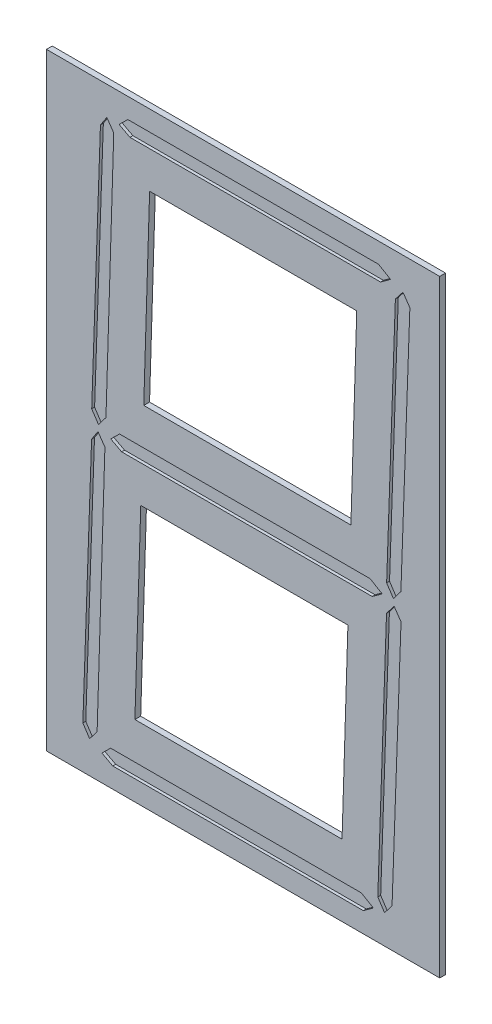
ISO-10303-21;
HEADER;
FILE_DESCRIPTION(('STEP AP214'),'2;1');
FILE_NAME('part.step','',(''),(''),'','','');
FILE_SCHEMA(('AUTOMOTIVE_DESIGN { 1 0 10303 214 1 1 1 1 }'));
ENDSEC;
DATA;
#1=APPLICATION_CONTEXT('core data for automotive mechanical design processes');
#2=APPLICATION_PROTOCOL_DEFINITION('international standard','automotive_design',2000,#1);
#3=PRODUCT_CONTEXT('',#1,'mechanical');
#4=PRODUCT('Part','Part','',(#3));
#5=PRODUCT_RELATED_PRODUCT_CATEGORY('part','',(#4));
#6=PRODUCT_DEFINITION_FORMATION('','',#4);
#7=PRODUCT_DEFINITION_CONTEXT('part definition',#1,'design');
#8=PRODUCT_DEFINITION('design','',#6,#7);
#9=PRODUCT_DEFINITION_SHAPE('','',#8);
#10=(LENGTH_UNIT() NAMED_UNIT(*) SI_UNIT(.MILLI.,.METRE.));
#11=(NAMED_UNIT(*) PLANE_ANGLE_UNIT() SI_UNIT($,.RADIAN.));
#12=(NAMED_UNIT(*) SI_UNIT($,.STERADIAN.) SOLID_ANGLE_UNIT());
#13=UNCERTAINTY_MEASURE_WITH_UNIT(LENGTH_MEASURE(1.E-05),#10,'distance_accuracy_value','');
#14=(GEOMETRIC_REPRESENTATION_CONTEXT(3) GLOBAL_UNCERTAINTY_ASSIGNED_CONTEXT((#13)) GLOBAL_UNIT_ASSIGNED_CONTEXT((#10,
#11,#12)) REPRESENTATION_CONTEXT('',''));
#15=CARTESIAN_POINT('',(0.,0.,0.));
#16=DIRECTION('',(0.,0.,1.));
#17=DIRECTION('',(1.,0.,0.));
#18=AXIS2_PLACEMENT_3D('',#15,#16,#17);
#19=CARTESIAN_POINT('',(0.,0.,0.));
#20=DIRECTION('',(0.,0.,-1.));
#21=DIRECTION('',(-1.,0.,0.));
#22=AXIS2_PLACEMENT_3D('',#19,#20,#21);
#23=PLANE('',#22);
#24=DIRECTION('',(0.031099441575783,0.999516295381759,0.));
#25=VECTOR('',#24,1.);
#26=CARTESIAN_POINT('',(109.911138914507,-3.41982923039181,0.));
#27=LINE('',#26,#25);
#28=CARTESIAN_POINT('',(102.258680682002,-249.364975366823,0.));
#29=VERTEX_POINT('',#28);
#30=CARTESIAN_POINT('',(108.315604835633,-54.6992809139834,0.));
#31=VERTEX_POINT('',#30);
#32=EDGE_CURVE('E904',#29,#31,#27,.T.);
#33=ORIENTED_EDGE('',*,*,#32,.F.);
#34=DIRECTION('',(0.999999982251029,-0.000188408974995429,0.));
#35=VECTOR('',#34,1.);
#36=CARTESIAN_POINT('',(-0.0469789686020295,-249.34570006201,0.));
#37=LINE('',#36,#35);
#38=CARTESIAN_POINT('',(-111.817598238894,-249.324641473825,0.));
#39=VERTEX_POINT('',#38);
#40=EDGE_CURVE('E913',#39,#29,#37,.T.);
#41=ORIENTED_EDGE('',*,*,#40,.F.);
#42=DIRECTION('',(-0.031099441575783,-0.999516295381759,0.));
#43=VECTOR('',#42,1.);
#44=CARTESIAN_POINT('',(-103.959344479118,3.2346421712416,0.));
#45=LINE('',#44,#43);
#46=CARTESIAN_POINT('',(-105.760674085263,-54.6589470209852,0.));
#47=VERTEX_POINT('',#46);
#48=EDGE_CURVE('E910',#47,#39,#45,.T.);
#49=ORIENTED_EDGE('',*,*,#48,.F.);
#50=DIRECTION('',(-0.999999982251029,0.000188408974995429,0.));
#51=VECTOR('',#50,1.);
#52=CARTESIAN_POINT('',(-0.0103019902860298,-54.6788713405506,0.));
#53=LINE('',#52,#51);
#54=EDGE_CURVE('E908',#31,#47,#53,.T.);
#55=ORIENTED_EDGE('',*,*,#54,.F.);
#56=EDGE_LOOP('',(#33,#41,#49,#55));
#57=FACE_BOUND('',#56,.T.);
#58=DIRECTION('',(1.,0.,0.));
#59=VECTOR('',#58,1.);
#60=CARTESIAN_POINT('',(-134.687828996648,-302.308947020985,0.));
#61=LINE('',#60,#59);
#62=CARTESIAN_POINT('',(-134.687828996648,-302.308947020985,0.));
#63=VERTEX_POINT('',#62);
#64=CARTESIAN_POINT('',(124.276847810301,-302.308947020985,0.));
#65=VERTEX_POINT('',#64);
#66=EDGE_CURVE('E832',#63,#65,#61,.T.);
#67=ORIENTED_EDGE('',*,*,#66,.F.);
#68=DIRECTION('',(0.884004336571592,-0.467478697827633,0.));
#69=VECTOR('',#68,1.);
#70=CARTESIAN_POINT('',(-145.929201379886,-296.364290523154,0.));
#71=LINE('',#70,#69);
#72=CARTESIAN_POINT('',(-145.929201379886,-296.364290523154,0.));
#73=VERTEX_POINT('',#72);
#74=EDGE_CURVE('E805',#73,#63,#71,.T.);
#75=ORIENTED_EDGE('',*,*,#74,.F.);
#76=DIRECTION('',(0.71431086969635,0.699828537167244,0.));
#77=VECTOR('',#76,1.);
#78=CARTESIAN_POINT('',(-145.929201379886,-296.364290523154,0.));
#79=LINE('',#78,#77);
#80=CARTESIAN_POINT('',(-136.845722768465,-287.464975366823,0.));
#81=VERTEX_POINT('',#80);
#82=EDGE_CURVE('E792',#73,#81,#79,.T.);
#83=ORIENTED_EDGE('',*,*,#82,.T.);
#84=DIRECTION('',(1.,0.,0.));
#85=VECTOR('',#84,1.);
#86=CARTESIAN_POINT('',(-136.845722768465,-287.464975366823,0.));
#87=LINE('',#86,#85);
#88=CARTESIAN_POINT('',(122.118954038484,-287.464975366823,0.));
#89=VERTEX_POINT('',#88);
#90=EDGE_CURVE('E823',#81,#89,#87,.T.);
#91=ORIENTED_EDGE('',*,*,#90,.T.);
#92=DIRECTION('',(-0.862615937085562,0.505859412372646,0.));
#93=VECTOR('',#92,1.);
#94=CARTESIAN_POINT('',(134.62,-294.795899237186,0.));
#95=LINE('',#94,#93);
#96=CARTESIAN_POINT('',(134.62,-294.795899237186,0.));
#97=VERTEX_POINT('',#96);
#98=EDGE_CURVE('E826',#97,#89,#95,.T.);
#99=ORIENTED_EDGE('',*,*,#98,.F.);
#100=DIRECTION('',(0.809079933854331,0.587698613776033,0.));
#101=VECTOR('',#100,1.);
#102=CARTESIAN_POINT('',(124.276847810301,-302.308947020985,0.));
#103=LINE('',#102,#101);
#104=EDGE_CURVE('E829',#65,#97,#103,.T.);
#105=ORIENTED_EDGE('',*,*,#104,.F.);
#106=EDGE_LOOP('',(#67,#75,#83,#91,#99,#105));
#107=FACE_BOUND('',#106,.T.);
#108=DIRECTION('',(-0.0348994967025,-0.999390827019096,0.));
#109=VECTOR('',#108,1.);
#110=CARTESIAN_POINT('',(-156.575627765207,-20.7634723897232,0.));
#111=LINE('',#110,#109);
#112=CARTESIAN_POINT('',(-156.575627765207,-20.7634723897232,0.));
#113=VERTEX_POINT('',#112);
#114=CARTESIAN_POINT('',(-165.603842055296,-279.297703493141,0.));
#115=VERTEX_POINT('',#114);
#116=EDGE_CURVE('E775',#113,#115,#111,.T.);
#117=ORIENTED_EDGE('',*,*,#116,.F.);
#118=DIRECTION('',(-0.546427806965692,-0.837506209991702,0.));
#119=VECTOR('',#118,1.);
#120=CARTESIAN_POINT('',(-149.993059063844,-10.6744137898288,0.));
#121=LINE('',#120,#119);
#122=CARTESIAN_POINT('',(-149.993059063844,-10.6744137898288,0.));
#123=VERTEX_POINT('',#122);
#124=EDGE_CURVE('E772',#123,#113,#121,.T.);
#125=ORIENTED_EDGE('',*,*,#124,.F.);
#126=DIRECTION('',(0.571378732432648,-0.820686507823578,0.));
#127=VECTOR('',#126,1.);
#128=CARTESIAN_POINT('',(-149.993059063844,-10.6744137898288,0.));
#129=LINE('',#128,#127);
#130=CARTESIAN_POINT('',(-142.812998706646,-20.9873259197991,0.));
#131=VERTEX_POINT('',#130);
#132=EDGE_CURVE('E757',#123,#131,#129,.T.);
#133=ORIENTED_EDGE('',*,*,#132,.T.);
#134=DIRECTION('',(0.0310994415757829,0.999516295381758,0.));
#135=VECTOR('',#134,1.);
#136=CARTESIAN_POINT('',(-150.865883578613,-279.801929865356,0.));
#137=LINE('',#136,#135);
#138=CARTESIAN_POINT('',(-150.865883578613,-279.801929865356,0.));
#139=VERTEX_POINT('',#138);
#140=EDGE_CURVE('E784',#139,#131,#137,.T.);
#141=ORIENTED_EDGE('',*,*,#140,.F.);
#142=DIRECTION('',(0.608378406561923,0.793647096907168,0.));
#143=VECTOR('',#142,1.);
#144=CARTESIAN_POINT('',(-158.600862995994,-289.892432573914,0.));
#145=LINE('',#144,#143);
#146=CARTESIAN_POINT('',(-158.600862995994,-289.892432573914,0.));
#147=VERTEX_POINT('',#146);
#148=EDGE_CURVE('E781',#147,#139,#145,.T.);
#149=ORIENTED_EDGE('',*,*,#148,.F.);
#150=DIRECTION('',(-0.551415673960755,0.834230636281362,0.));
#151=VECTOR('',#150,1.);
#152=CARTESIAN_POINT('',(-158.600862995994,-289.892432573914,0.));
#153=LINE('',#152,#151);
#154=EDGE_CURVE('E778',#147,#115,#153,.T.);
#155=ORIENTED_EDGE('',*,*,#154,.T.);
#156=EDGE_LOOP('',(#117,#125,#133,#141,#149,#155));
#157=FACE_BOUND('',#156,.T.);
#158=DIRECTION('',(0.571378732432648,-0.820686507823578,0.));
#159=VECTOR('',#158,1.);
#160=CARTESIAN_POINT('',(34.1236668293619,23.7575947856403,0.));
#161=LINE('',#160,#159);
#162=CARTESIAN_POINT('',(-140.849059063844,275.075586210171,0.));
#163=VERTEX_POINT('',#162);
#164=CARTESIAN_POINT('',(-133.668998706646,264.762674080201,0.));
#165=VERTEX_POINT('',#164);
#166=EDGE_CURVE('E599',#163,#165,#161,.T.);
#167=ORIENTED_EDGE('',*,*,#166,.T.);
#168=DIRECTION('',(0.031099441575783,0.999516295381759,0.));
#169=VECTOR('',#168,1.);
#170=CARTESIAN_POINT('',(-141.769705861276,4.41109235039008,0.));
#171=LINE('',#170,#169);
#172=CARTESIAN_POINT('',(-141.721883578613,5.9480701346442,0.));
#173=VERTEX_POINT('',#172);
#174=EDGE_CURVE('E617',#173,#165,#171,.T.);
#175=ORIENTED_EDGE('',*,*,#174,.F.);
#176=DIRECTION('',(0.608378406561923,0.793647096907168,0.));
#177=VECTOR('',#176,1.);
#178=CARTESIAN_POINT('',(-92.1391255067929,70.6302014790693,0.));
#179=LINE('',#178,#177);
#180=CARTESIAN_POINT('',(-149.456862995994,-4.14243257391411,0.));
#181=VERTEX_POINT('',#180);
#182=EDGE_CURVE('E644',#181,#173,#179,.T.);
#183=ORIENTED_EDGE('',*,*,#182,.F.);
#184=DIRECTION('',(-0.551415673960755,0.834230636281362,0.));
#185=VECTOR('',#184,1.);
#186=CARTESIAN_POINT('',(-105.918673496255,-70.0108749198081,0.));
#187=LINE('',#186,#185);
#188=CARTESIAN_POINT('',(-156.459842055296,6.45229650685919,0.));
#189=VERTEX_POINT('',#188);
#190=EDGE_CURVE('E641',#181,#189,#187,.T.);
#191=ORIENTED_EDGE('',*,*,#190,.T.);
#192=DIRECTION('',(-0.0348994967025,-0.999390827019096,0.));
#193=VECTOR('',#192,1.);
#194=CARTESIAN_POINT('',(-156.49432262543,5.46490216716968,0.));
#195=LINE('',#194,#193);
#196=CARTESIAN_POINT('',(-147.431627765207,264.986527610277,0.));
#197=VERTEX_POINT('',#196);
#198=EDGE_CURVE('E638',#197,#189,#195,.T.);
#199=ORIENTED_EDGE('',*,*,#198,.F.);
#200=DIRECTION('',(-0.546427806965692,-0.837506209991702,0.));
#201=VECTOR('',#200,1.);
#202=CARTESIAN_POINT('',(-224.678553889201,146.590685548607,0.));
#203=LINE('',#202,#201);
#204=EDGE_CURVE('E635',#163,#197,#203,.T.);
#205=ORIENTED_EDGE('',*,*,#204,.F.);
#206=EDGE_LOOP('',(#167,#175,#183,#191,#199,#205));
#207=FACE_BOUND('',#206,.T.);
#208=DIRECTION('',(0.0358309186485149,0.999357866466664,0.));
#209=VECTOR('',#208,1.);
#210=CARTESIAN_POINT('',(153.934116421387,-283.159497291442,0.));
#211=LINE('',#210,#209);
#212=CARTESIAN_POINT('',(153.934116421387,-283.159497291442,0.));
#213=VERTEX_POINT('',#212);
#214=CARTESIAN_POINT('',(163.212169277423,-24.3859169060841,0.));
#215=VERTEX_POINT('',#214);
#216=EDGE_CURVE('E727',#213,#215,#211,.T.);
#217=ORIENTED_EDGE('',*,*,#216,.F.);
#218=DIRECTION('',(0.608378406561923,0.793647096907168,0.));
#219=VECTOR('',#218,1.);
#220=CARTESIAN_POINT('',(146.199137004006,-293.25,0.));
#221=LINE('',#220,#219);
#222=CARTESIAN_POINT('',(146.199137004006,-293.25,0.));
#223=VERTEX_POINT('',#222);
#224=EDGE_CURVE('E698',#223,#213,#221,.T.);
#225=ORIENTED_EDGE('',*,*,#224,.F.);
#226=DIRECTION('',(-0.551415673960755,0.834230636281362,0.));
#227=VECTOR('',#226,1.);
#228=CARTESIAN_POINT('',(146.199137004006,-293.25,0.));
#229=LINE('',#228,#227);
#230=CARTESIAN_POINT('',(139.196157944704,-282.655270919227,0.));
#231=VERTEX_POINT('',#230);
#232=EDGE_CURVE('E711',#223,#231,#229,.T.);
#233=ORIENTED_EDGE('',*,*,#232,.T.);
#234=DIRECTION('',(-0.0348994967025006,-0.999390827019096,0.));
#235=VECTOR('',#234,1.);
#236=CARTESIAN_POINT('',(148.224372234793,-24.1210398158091,0.));
#237=LINE('',#236,#235);
#238=CARTESIAN_POINT('',(148.224372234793,-24.1210398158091,0.));
#239=VERTEX_POINT('',#238);
#240=EDGE_CURVE('E736',#239,#231,#237,.T.);
#241=ORIENTED_EDGE('',*,*,#240,.F.);
#242=DIRECTION('',(-0.614679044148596,-0.788777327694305,0.));
#243=VECTOR('',#242,1.);
#244=CARTESIAN_POINT('',(156.081011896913,-14.0391291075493,0.));
#245=LINE('',#244,#243);
#246=CARTESIAN_POINT('',(156.081011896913,-14.0391291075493,0.));
#247=VERTEX_POINT('',#246);
#248=EDGE_CURVE('E733',#247,#239,#245,.T.);
#249=ORIENTED_EDGE('',*,*,#248,.F.);
#250=DIRECTION('',(0.567487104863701,-0.823382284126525,0.));
#251=VECTOR('',#250,1.);
#252=CARTESIAN_POINT('',(156.081011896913,-14.0391291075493,0.));
#253=LINE('',#252,#251);
#254=EDGE_CURVE('E730',#247,#215,#253,.T.);
#255=ORIENTED_EDGE('',*,*,#254,.T.);
#256=EDGE_LOOP('',(#217,#225,#233,#241,#249,#255));
#257=FACE_BOUND('',#256,.T.);
#258=DIRECTION('',(1.,0.,0.));
#259=VECTOR('',#258,1.);
#260=CARTESIAN_POINT('',(-125.543828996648,-16.5589470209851,0.));
#261=LINE('',#260,#259);
#262=CARTESIAN_POINT('',(-125.543828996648,-16.5589470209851,0.));
#263=VERTEX_POINT('',#262);
#264=CARTESIAN_POINT('',(133.420847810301,-16.5589470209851,0.));
#265=VERTEX_POINT('',#264);
#266=EDGE_CURVE('E681',#263,#265,#261,.T.);
#267=ORIENTED_EDGE('',*,*,#266,.F.);
#268=DIRECTION('',(0.884004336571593,-0.467478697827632,0.));
#269=VECTOR('',#268,1.);
#270=CARTESIAN_POINT('',(-136.785201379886,-10.6142905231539,0.));
#271=LINE('',#270,#269);
#272=CARTESIAN_POINT('',(-136.785201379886,-10.6142905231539,0.));
#273=VERTEX_POINT('',#272);
#274=EDGE_CURVE('E652',#273,#263,#271,.T.);
#275=ORIENTED_EDGE('',*,*,#274,.F.);
#276=DIRECTION('',(0.71431086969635,0.699828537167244,0.));
#277=VECTOR('',#276,1.);
#278=CARTESIAN_POINT('',(-136.785201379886,-10.6142905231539,0.));
#279=LINE('',#278,#277);
#280=CARTESIAN_POINT('',(-127.701722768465,-1.71497536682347,0.));
#281=VERTEX_POINT('',#280);
#282=EDGE_CURVE('E665',#273,#281,#279,.T.);
#283=ORIENTED_EDGE('',*,*,#282,.T.);
#284=DIRECTION('',(1.,0.,0.));
#285=VECTOR('',#284,1.);
#286=CARTESIAN_POINT('',(-127.701722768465,-1.71497536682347,0.));
#287=LINE('',#286,#285);
#288=CARTESIAN_POINT('',(131.262954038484,-1.71497536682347,0.));
#289=VERTEX_POINT('',#288);
#290=EDGE_CURVE('E690',#281,#289,#287,.T.);
#291=ORIENTED_EDGE('',*,*,#290,.T.);
#292=DIRECTION('',(-0.862615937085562,0.505859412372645,0.));
#293=VECTOR('',#292,1.);
#294=CARTESIAN_POINT('',(143.764,-9.04589923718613,0.));
#295=LINE('',#294,#293);
#296=CARTESIAN_POINT('',(143.764,-9.04589923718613,0.));
#297=VERTEX_POINT('',#296);
#298=EDGE_CURVE('E687',#297,#289,#295,.T.);
#299=ORIENTED_EDGE('',*,*,#298,.F.);
#300=DIRECTION('',(0.809079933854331,0.587698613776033,0.));
#301=VECTOR('',#300,1.);
#302=CARTESIAN_POINT('',(133.420847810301,-16.5589470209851,0.));
#303=LINE('',#302,#301);
#304=EDGE_CURVE('E684',#265,#297,#303,.T.);
#305=ORIENTED_EDGE('',*,*,#304,.F.);
#306=EDGE_LOOP('',(#267,#275,#283,#291,#299,#305));
#307=FACE_BOUND('',#306,.T.);
#308=DIRECTION('',(0.71431086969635,0.699828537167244,0.));
#309=VECTOR('',#308,1.);
#310=CARTESIAN_POINT('',(-200.301352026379,204.446411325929,0.));
#311=LINE('',#310,#309);
#312=CARTESIAN_POINT('',(-128.149201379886,275.135709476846,0.));
#313=VERTEX_POINT('',#312);
#314=CARTESIAN_POINT('',(-119.065722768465,284.035024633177,0.));
#315=VERTEX_POINT('',#314);
#316=EDGE_CURVE('E596',#313,#315,#311,.T.);
#317=ORIENTED_EDGE('',*,*,#316,.T.);
#318=DIRECTION('',(1.,0.,0.));
#319=VECTOR('',#318,1.);
#320=CARTESIAN_POINT('',(0.,284.035024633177,0.));
#321=LINE('',#320,#319);
#322=CARTESIAN_POINT('',(139.898954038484,284.035024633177,0.));
#323=VERTEX_POINT('',#322);
#324=EDGE_CURVE('E580',#315,#323,#321,.T.);
#325=ORIENTED_EDGE('',*,*,#324,.T.);
#326=DIRECTION('',(-0.862615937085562,0.505859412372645,0.));
#327=VECTOR('',#326,1.);
#328=CARTESIAN_POINT('',(159.741469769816,272.398880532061,0.));
#329=LINE('',#328,#327);
#330=CARTESIAN_POINT('',(152.4,276.704100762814,0.));
#331=VERTEX_POINT('',#330);
#332=EDGE_CURVE('E584',#331,#323,#329,.T.);
#333=ORIENTED_EDGE('',*,*,#332,.F.);
#334=DIRECTION('',(0.809079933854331,0.587698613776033,0.));
#335=VECTOR('',#334,1.);
#336=CARTESIAN_POINT('',(-78.9340751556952,108.667903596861,0.));
#337=LINE('',#336,#335);
#338=CARTESIAN_POINT('',(142.056847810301,269.191052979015,0.));
#339=VERTEX_POINT('',#338);
#340=EDGE_CURVE('E587',#339,#331,#337,.T.);
#341=ORIENTED_EDGE('',*,*,#340,.F.);
#342=DIRECTION('',(1.,0.,0.));
#343=VECTOR('',#342,1.);
#344=CARTESIAN_POINT('',(0.,269.191052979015,0.));
#345=LINE('',#344,#343);
#346=CARTESIAN_POINT('',(-116.907828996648,269.191052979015,0.));
#347=VERTEX_POINT('',#346);
#348=EDGE_CURVE('E590',#347,#339,#345,.T.);
#349=ORIENTED_EDGE('',*,*,#348,.F.);
#350=DIRECTION('',(0.884004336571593,-0.467478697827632,0.));
#351=VECTOR('',#350,1.);
#352=CARTESIAN_POINT('',(85.6954547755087,162.050493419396,0.));
#353=LINE('',#352,#351);
#354=EDGE_CURVE('E593',#313,#347,#353,.T.);
#355=ORIENTED_EDGE('',*,*,#354,.F.);
#356=EDGE_LOOP('',(#317,#325,#333,#341,#349,#355));
#357=FACE_BOUND('',#356,.T.);
#358=DIRECTION('',(-0.0348994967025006,-0.999390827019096,0.));
#359=VECTOR('',#358,1.);
#360=CARTESIAN_POINT('',(157.368372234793,261.628960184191,0.));
#361=LINE('',#360,#359);
#362=CARTESIAN_POINT('',(157.368372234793,261.628960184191,0.));
#363=VERTEX_POINT('',#362);
#364=CARTESIAN_POINT('',(148.340157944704,3.09472908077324,0.));
#365=VERTEX_POINT('',#364);
#366=EDGE_CURVE('E870',#363,#365,#361,.T.);
#367=ORIENTED_EDGE('',*,*,#366,.F.);
#368=DIRECTION('',(-0.614679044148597,-0.788777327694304,0.));
#369=VECTOR('',#368,1.);
#370=CARTESIAN_POINT('',(165.225011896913,271.710870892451,0.));
#371=LINE('',#370,#369);
#372=CARTESIAN_POINT('',(165.225011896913,271.710870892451,0.));
#373=VERTEX_POINT('',#372);
#374=EDGE_CURVE('E744',#373,#363,#371,.T.);
#375=ORIENTED_EDGE('',*,*,#374,.F.);
#376=DIRECTION('',(0.567487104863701,-0.823382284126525,0.));
#377=VECTOR('',#376,1.);
#378=CARTESIAN_POINT('',(165.225011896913,271.710870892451,0.));
#379=LINE('',#378,#377);
#380=CARTESIAN_POINT('',(172.356169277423,261.364083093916,0.));
#381=VERTEX_POINT('',#380);
#382=EDGE_CURVE('E854',#373,#381,#379,.T.);
#383=ORIENTED_EDGE('',*,*,#382,.T.);
#384=DIRECTION('',(0.0358309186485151,0.999357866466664,0.));
#385=VECTOR('',#384,1.);
#386=CARTESIAN_POINT('',(163.078116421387,2.59050270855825,0.));
#387=LINE('',#386,#385);
#388=CARTESIAN_POINT('',(163.078116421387,2.59050270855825,0.));
#389=VERTEX_POINT('',#388);
#390=EDGE_CURVE('E879',#389,#381,#387,.T.);
#391=ORIENTED_EDGE('',*,*,#390,.F.);
#392=DIRECTION('',(0.608378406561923,0.793647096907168,0.));
#393=VECTOR('',#392,1.);
#394=CARTESIAN_POINT('',(155.343137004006,-7.50000000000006,0.));
#395=LINE('',#394,#393);
#396=CARTESIAN_POINT('',(155.343137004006,-7.50000000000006,0.));
#397=VERTEX_POINT('',#396);
#398=EDGE_CURVE('E876',#397,#389,#395,.T.);
#399=ORIENTED_EDGE('',*,*,#398,.F.);
#400=DIRECTION('',(-0.551415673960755,0.834230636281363,0.));
#401=VECTOR('',#400,1.);
#402=CARTESIAN_POINT('',(155.343137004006,-7.50000000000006,0.));
#403=LINE('',#402,#401);
#404=EDGE_CURVE('E873',#397,#365,#403,.T.);
#405=ORIENTED_EDGE('',*,*,#404,.T.);
#406=EDGE_LOOP('',(#367,#375,#383,#391,#399,#405));
#407=FACE_BOUND('',#406,.T.);
#408=DIRECTION('',(0.,-1.,0.));
#409=VECTOR('',#408,1.);
#410=CARTESIAN_POINT('',(-203.2,304.8,0.));
#411=LINE('',#410,#409);
#412=CARTESIAN_POINT('',(-203.2,304.8,0.));
#413=VERTEX_POINT('',#412);
#414=CARTESIAN_POINT('',(-203.2,-323.136947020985,0.));
#415=VERTEX_POINT('',#414);
#416=EDGE_CURVE('E552',#413,#415,#411,.T.);
#417=ORIENTED_EDGE('',*,*,#416,.T.);
#418=DIRECTION('',(1.,0.,0.));
#419=VECTOR('',#418,1.);
#420=CARTESIAN_POINT('',(-203.2,-323.136947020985,0.));
#421=LINE('',#420,#419);
#422=CARTESIAN_POINT('',(203.2,-323.136947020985,0.));
#423=VERTEX_POINT('',#422);
#424=EDGE_CURVE('E901',#415,#423,#421,.T.);
#425=ORIENTED_EDGE('',*,*,#424,.T.);
#426=DIRECTION('',(0.,-1.,0.));
#427=VECTOR('',#426,1.);
#428=CARTESIAN_POINT('',(203.2,304.8,0.));
#429=LINE('',#428,#427);
#430=CARTESIAN_POINT('',(203.2,304.8,0.));
#431=VERTEX_POINT('',#430);
#432=EDGE_CURVE('E555',#431,#423,#429,.T.);
#433=ORIENTED_EDGE('',*,*,#432,.F.);
#434=DIRECTION('',(1.,0.,0.));
#435=VECTOR('',#434,1.);
#436=CARTESIAN_POINT('',(-203.2,304.8,0.));
#437=LINE('',#436,#435);
#438=EDGE_CURVE('E557',#413,#431,#437,.T.);
#439=ORIENTED_EDGE('',*,*,#438,.F.);
#440=EDGE_LOOP('',(#417,#425,#433,#439));
#441=FACE_BOUND('',#440,.T.);
#442=DIRECTION('',(0.0310994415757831,0.999516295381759,0.));
#443=VECTOR('',#442,1.);
#444=CARTESIAN_POINT('',(110.163928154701,-3.42769463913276,0.));
#445=LINE('',#444,#443);
#446=CARTESIAN_POINT('',(111.402680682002,36.3850246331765,0.));
#447=VERTEX_POINT('',#446);
#448=CARTESIAN_POINT('',(117.460859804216,231.091052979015,0.));
#449=VERTEX_POINT('',#448);
#450=EDGE_CURVE('E926',#447,#449,#445,.T.);
#451=ORIENTED_EDGE('',*,*,#450,.F.);
#452=DIRECTION('',(1.,0.,0.));
#453=VECTOR('',#452,1.);
#454=CARTESIAN_POINT('',(0.,36.3850246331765,0.));
#455=LINE('',#454,#453);
#456=CARTESIAN_POINT('',(-102.674853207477,36.3850246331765,0.));
#457=VERTEX_POINT('',#456);
#458=EDGE_CURVE('E931',#457,#447,#455,.T.);
#459=ORIENTED_EDGE('',*,*,#458,.F.);
#460=DIRECTION('',(-0.0310994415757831,-0.999516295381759,0.));
#461=VECTOR('',#460,1.);
#462=CARTESIAN_POINT('',(-103.706555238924,3.22677676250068,0.));
#463=LINE('',#462,#461);
#464=CARTESIAN_POINT('',(-96.6166740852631,231.091052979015,0.));
#465=VERTEX_POINT('',#464);
#466=EDGE_CURVE('E527',#465,#457,#463,.T.);
#467=ORIENTED_EDGE('',*,*,#466,.F.);
#468=DIRECTION('',(-1.,0.,0.));
#469=VECTOR('',#468,1.);
#470=CARTESIAN_POINT('',(0.,231.091052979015,0.));
#471=LINE('',#470,#469);
#472=EDGE_CURVE('E928',#449,#465,#471,.T.);
#473=ORIENTED_EDGE('',*,*,#472,.F.);
#474=EDGE_LOOP('',(#451,#459,#467,#473));
#475=FACE_BOUND('',#474,.T.);
#476=ADVANCED_FACE('F177',(#57,#107,#157,#207,#257,#307,#357,#407,#441,#475),#23,.F.);
#477=CARTESIAN_POINT('',(0.,0.,-6.));
#478=DIRECTION('',(0.,0.,-1.));
#479=DIRECTION('',(-1.,0.,0.));
#480=AXIS2_PLACEMENT_3D('',#477,#478,#479);
#481=PLANE('',#480);
#482=DIRECTION('',(0.,-1.,0.));
#483=VECTOR('',#482,1.);
#484=CARTESIAN_POINT('',(203.2,304.8,-6.));
#485=LINE('',#484,#483);
#486=CARTESIAN_POINT('',(203.2,304.8,-6.));
#487=VERTEX_POINT('',#486);
#488=CARTESIAN_POINT('',(203.2,-323.136947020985,-6.));
#489=VERTEX_POINT('',#488);
#490=EDGE_CURVE('E562',#487,#489,#485,.T.);
#491=ORIENTED_EDGE('',*,*,#490,.T.);
#492=DIRECTION('',(1.,0.,0.));
#493=VECTOR('',#492,1.);
#494=CARTESIAN_POINT('',(-203.2,-323.136947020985,-6.));
#495=LINE('',#494,#493);
#496=CARTESIAN_POINT('',(-203.2,-323.136947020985,-6.));
#497=VERTEX_POINT('',#496);
#498=EDGE_CURVE('E898',#497,#489,#495,.T.);
#499=ORIENTED_EDGE('',*,*,#498,.F.);
#500=DIRECTION('',(0.,-1.,0.));
#501=VECTOR('',#500,1.);
#502=CARTESIAN_POINT('',(-203.2,304.8,-6.));
#503=LINE('',#502,#501);
#504=CARTESIAN_POINT('',(-203.2,304.8,-6.));
#505=VERTEX_POINT('',#504);
#506=EDGE_CURVE('E551',#505,#497,#503,.T.);
#507=ORIENTED_EDGE('',*,*,#506,.F.);
#508=DIRECTION('',(1.,0.,0.));
#509=VECTOR('',#508,1.);
#510=CARTESIAN_POINT('',(-203.2,304.8,-6.));
#511=LINE('',#510,#509);
#512=EDGE_CURVE('E554',#505,#487,#511,.T.);
#513=ORIENTED_EDGE('',*,*,#512,.T.);
#514=EDGE_LOOP('',(#491,#499,#507,#513));
#515=FACE_BOUND('',#514,.T.);
#516=DIRECTION('',(0.999999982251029,-0.000188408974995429,0.));
#517=VECTOR('',#516,1.);
#518=CARTESIAN_POINT('',(-0.0469789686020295,-249.34570006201,-6.));
#519=LINE('',#518,#517);
#520=CARTESIAN_POINT('',(-111.817598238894,-249.324641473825,-6.00000000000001));
#521=VERTEX_POINT('',#520);
#522=CARTESIAN_POINT('',(102.258680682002,-249.364975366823,-6.));
#523=VERTEX_POINT('',#522);
#524=EDGE_CURVE('E543',#521,#523,#519,.T.);
#525=ORIENTED_EDGE('',*,*,#524,.T.);
#526=DIRECTION('',(0.031099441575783,0.999516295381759,0.));
#527=VECTOR('',#526,1.);
#528=CARTESIAN_POINT('',(109.911138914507,-3.41982923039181,-6.));
#529=LINE('',#528,#527);
#530=CARTESIAN_POINT('',(108.315604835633,-54.6992809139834,-6.00000000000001));
#531=VERTEX_POINT('',#530);
#532=EDGE_CURVE('E520',#523,#531,#529,.T.);
#533=ORIENTED_EDGE('',*,*,#532,.T.);
#534=DIRECTION('',(-0.999999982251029,0.000188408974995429,0.));
#535=VECTOR('',#534,1.);
#536=CARTESIAN_POINT('',(-0.0103019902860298,-54.6788713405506,-6.));
#537=LINE('',#536,#535);
#538=CARTESIAN_POINT('',(-105.760674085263,-54.6589470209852,-6.00000000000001));
#539=VERTEX_POINT('',#538);
#540=EDGE_CURVE('E537',#531,#539,#537,.T.);
#541=ORIENTED_EDGE('',*,*,#540,.T.);
#542=DIRECTION('',(-0.031099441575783,-0.999516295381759,0.));
#543=VECTOR('',#542,1.);
#544=CARTESIAN_POINT('',(-103.959344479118,3.2346421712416,-6.));
#545=LINE('',#544,#543);
#546=EDGE_CURVE('E540',#539,#521,#545,.T.);
#547=ORIENTED_EDGE('',*,*,#546,.T.);
#548=EDGE_LOOP('',(#525,#533,#541,#547));
#549=FACE_BOUND('',#548,.T.);
#550=DIRECTION('',(1.,0.,0.));
#551=VECTOR('',#550,1.);
#552=CARTESIAN_POINT('',(0.,36.3850246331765,-6.));
#553=LINE('',#552,#551);
#554=CARTESIAN_POINT('',(-102.674853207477,36.3850246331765,-6.00000000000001));
#555=VERTEX_POINT('',#554);
#556=CARTESIAN_POINT('',(111.402680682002,36.3850246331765,-6.));
#557=VERTEX_POINT('',#556);
#558=EDGE_CURVE('E515',#555,#557,#553,.T.);
#559=ORIENTED_EDGE('',*,*,#558,.T.);
#560=DIRECTION('',(0.0310994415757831,0.999516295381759,0.));
#561=VECTOR('',#560,1.);
#562=CARTESIAN_POINT('',(110.163928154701,-3.42769463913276,-6.));
#563=LINE('',#562,#561);
#564=CARTESIAN_POINT('',(117.460859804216,231.091052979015,-6.00000000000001));
#565=VERTEX_POINT('',#564);
#566=EDGE_CURVE('E12',#557,#565,#563,.T.);
#567=ORIENTED_EDGE('',*,*,#566,.T.);
#568=DIRECTION('',(-1.,0.,0.));
#569=VECTOR('',#568,1.);
#570=CARTESIAN_POINT('',(0.,231.091052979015,-6.));
#571=LINE('',#570,#569);
#572=CARTESIAN_POINT('',(-96.6166740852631,231.091052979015,-6.00000000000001));
#573=VERTEX_POINT('',#572);
#574=EDGE_CURVE('E185',#565,#573,#571,.T.);
#575=ORIENTED_EDGE('',*,*,#574,.T.);
#576=DIRECTION('',(-0.0310994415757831,-0.999516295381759,0.));
#577=VECTOR('',#576,1.);
#578=CARTESIAN_POINT('',(-103.706555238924,3.22677676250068,-6.));
#579=LINE('',#578,#577);
#580=EDGE_CURVE('E519',#573,#555,#579,.T.);
#581=ORIENTED_EDGE('',*,*,#580,.T.);
#582=EDGE_LOOP('',(#559,#567,#575,#581));
#583=FACE_BOUND('',#582,.T.);
#584=ADVANCED_FACE('F532',(#515,#549,#583),#481,.T.);
#585=CARTESIAN_POINT('',(-203.2,304.8,-6.));
#586=DIRECTION('',(0.,-1.,0.));
#587=DIRECTION('',(0.,0.,-1.));
#588=AXIS2_PLACEMENT_3D('',#585,#586,#587);
#589=PLANE('',#588);
#590=ORIENTED_EDGE('',*,*,#438,.T.);
#591=DIRECTION('',(0.,0.,1.));
#592=VECTOR('',#591,1.);
#593=CARTESIAN_POINT('',(203.2,304.8,-6.));
#594=LINE('',#593,#592);
#595=EDGE_CURVE('E546',#487,#431,#594,.T.);
#596=ORIENTED_EDGE('',*,*,#595,.F.);
#597=ORIENTED_EDGE('',*,*,#512,.F.);
#598=DIRECTION('',(0.,0.,1.));
#599=VECTOR('',#598,1.);
#600=CARTESIAN_POINT('',(-203.2,304.8,-6.));
#601=LINE('',#600,#599);
#602=EDGE_CURVE('E549',#505,#413,#601,.T.);
#603=ORIENTED_EDGE('',*,*,#602,.T.);
#604=EDGE_LOOP('',(#590,#596,#597,#603));
#605=FACE_BOUND('',#604,.T.);
#606=ADVANCED_FACE('F179',(#605),#589,.F.);
#607=CARTESIAN_POINT('',(203.2,304.8,-6.));
#608=DIRECTION('',(-1.,0.,0.));
#609=DIRECTION('',(0.,-1.,0.));
#610=AXIS2_PLACEMENT_3D('',#607,#608,#609);
#611=PLANE('',#610);
#612=ORIENTED_EDGE('',*,*,#432,.T.);
#613=DIRECTION('',(0.,0.,1.));
#614=VECTOR('',#613,1.);
#615=CARTESIAN_POINT('',(203.2,-323.136947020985,-6.));
#616=LINE('',#615,#614);
#617=EDGE_CURVE('E850',#489,#423,#616,.T.);
#618=ORIENTED_EDGE('',*,*,#617,.F.);
#619=ORIENTED_EDGE('',*,*,#490,.F.);
#620=ORIENTED_EDGE('',*,*,#595,.T.);
#621=EDGE_LOOP('',(#612,#618,#619,#620));
#622=FACE_BOUND('',#621,.T.);
#623=ADVANCED_FACE('F971',(#622),#611,.F.);
#624=CARTESIAN_POINT('',(-203.2,304.8,-6.));
#625=DIRECTION('',(-1.,0.,0.));
#626=DIRECTION('',(0.,-1.,0.));
#627=AXIS2_PLACEMENT_3D('',#624,#625,#626);
#628=PLANE('',#627);
#629=ORIENTED_EDGE('',*,*,#506,.T.);
#630=DIRECTION('',(0.,0.,1.));
#631=VECTOR('',#630,1.);
#632=CARTESIAN_POINT('',(-203.2,-323.136947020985,-6.));
#633=LINE('',#632,#631);
#634=EDGE_CURVE('E895',#497,#415,#633,.T.);
#635=ORIENTED_EDGE('',*,*,#634,.T.);
#636=ORIENTED_EDGE('',*,*,#416,.F.);
#637=ORIENTED_EDGE('',*,*,#602,.F.);
#638=EDGE_LOOP('',(#629,#635,#636,#637));
#639=FACE_BOUND('',#638,.T.);
#640=ADVANCED_FACE('F968',(#639),#628,.T.);
#641=CARTESIAN_POINT('',(-200.301352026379,204.446411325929,-3.));
#642=DIRECTION('',(0.699828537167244,-0.71431086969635,0.));
#643=DIRECTION('',(0.71431086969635,0.699828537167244,0.));
#644=AXIS2_PLACEMENT_3D('',#641,#642,#643);
#645=PLANE('',#644);
#646=ORIENTED_EDGE('',*,*,#316,.F.);
#647=DIRECTION('',(0.,0.,1.));
#648=VECTOR('',#647,1.);
#649=CARTESIAN_POINT('',(-128.149201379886,275.135709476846,-3.));
#650=LINE('',#649,#648);
#651=CARTESIAN_POINT('',(-128.149201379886,275.135709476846,-3.));
#652=VERTEX_POINT('',#651);
#653=EDGE_CURVE('E566',#652,#313,#650,.T.);
#654=ORIENTED_EDGE('',*,*,#653,.F.);
#655=DIRECTION('',(0.71431086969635,0.699828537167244,0.));
#656=VECTOR('',#655,1.);
#657=CARTESIAN_POINT('',(-200.301352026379,204.446411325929,-3.));
#658=LINE('',#657,#656);
#659=CARTESIAN_POINT('',(-119.065722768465,284.035024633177,-3.));
#660=VERTEX_POINT('',#659);
#661=EDGE_CURVE('E583',#652,#660,#658,.T.);
#662=ORIENTED_EDGE('',*,*,#661,.T.);
#663=DIRECTION('',(0.,0.,1.));
#664=VECTOR('',#663,1.);
#665=CARTESIAN_POINT('',(-119.065722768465,284.035024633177,-3.));
#666=LINE('',#665,#664);
#667=EDGE_CURVE('E560',#660,#315,#666,.T.);
#668=ORIENTED_EDGE('',*,*,#667,.T.);
#669=EDGE_LOOP('',(#646,#654,#662,#668));
#670=FACE_BOUND('',#669,.T.);
#671=ADVANCED_FACE('F970',(#670),#645,.T.);
#672=CARTESIAN_POINT('',(0.,284.035024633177,-3.));
#673=DIRECTION('',(0.,-1.,0.));
#674=DIRECTION('',(0.,0.,-1.));
#675=AXIS2_PLACEMENT_3D('',#672,#673,#674);
#676=PLANE('',#675);
#677=ORIENTED_EDGE('',*,*,#324,.F.);
#678=ORIENTED_EDGE('',*,*,#667,.F.);
#679=DIRECTION('',(1.,0.,0.));
#680=VECTOR('',#679,1.);
#681=CARTESIAN_POINT('',(0.,284.035024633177,-3.));
#682=LINE('',#681,#680);
#683=CARTESIAN_POINT('',(139.898954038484,284.035024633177,-3.));
#684=VERTEX_POINT('',#683);
#685=EDGE_CURVE('E570',#660,#684,#682,.T.);
#686=ORIENTED_EDGE('',*,*,#685,.T.);
#687=DIRECTION('',(0.,0.,1.));
#688=VECTOR('',#687,1.);
#689=CARTESIAN_POINT('',(139.898954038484,284.035024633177,-3.));
#690=LINE('',#689,#688);
#691=EDGE_CURVE('E576',#684,#323,#690,.T.);
#692=ORIENTED_EDGE('',*,*,#691,.T.);
#693=EDGE_LOOP('',(#677,#678,#686,#692));
#694=FACE_BOUND('',#693,.T.);
#695=ADVANCED_FACE('F1188',(#694),#676,.T.);
#696=CARTESIAN_POINT('',(159.741469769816,272.398880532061,-3.));
#697=DIRECTION('',(0.505859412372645,0.862615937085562,0.));
#698=DIRECTION('',(-0.862615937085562,0.505859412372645,0.));
#699=AXIS2_PLACEMENT_3D('',#696,#697,#698);
#700=PLANE('',#699);
#701=ORIENTED_EDGE('',*,*,#332,.T.);
#702=ORIENTED_EDGE('',*,*,#691,.F.);
#703=DIRECTION('',(-0.862615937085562,0.505859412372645,0.));
#704=VECTOR('',#703,1.);
#705=CARTESIAN_POINT('',(159.741469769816,272.398880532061,-3.));
#706=LINE('',#705,#704);
#707=CARTESIAN_POINT('',(152.4,276.704100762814,-3.));
#708=VERTEX_POINT('',#707);
#709=EDGE_CURVE('E601',#708,#684,#706,.T.);
#710=ORIENTED_EDGE('',*,*,#709,.F.);
#711=DIRECTION('',(0.,0.,1.));
#712=VECTOR('',#711,1.);
#713=CARTESIAN_POINT('',(152.4,276.704100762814,-3.));
#714=LINE('',#713,#712);
#715=EDGE_CURVE('E574',#708,#331,#714,.T.);
#716=ORIENTED_EDGE('',*,*,#715,.T.);
#717=EDGE_LOOP('',(#701,#702,#710,#716));
#718=FACE_BOUND('',#717,.T.);
#719=ADVANCED_FACE('F1191',(#718),#700,.F.);
#720=CARTESIAN_POINT('',(-78.9340751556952,108.667903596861,-3.));
#721=DIRECTION('',(0.587698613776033,-0.809079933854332,0.));
#722=DIRECTION('',(0.809079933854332,0.587698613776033,0.));
#723=AXIS2_PLACEMENT_3D('',#720,#721,#722);
#724=PLANE('',#723);
#725=ORIENTED_EDGE('',*,*,#340,.T.);
#726=ORIENTED_EDGE('',*,*,#715,.F.);
#727=DIRECTION('',(0.809079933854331,0.587698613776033,0.));
#728=VECTOR('',#727,1.);
#729=CARTESIAN_POINT('',(-78.9340751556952,108.667903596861,-3.));
#730=LINE('',#729,#728);
#731=CARTESIAN_POINT('',(142.056847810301,269.191052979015,-3.));
#732=VERTEX_POINT('',#731);
#733=EDGE_CURVE('E604',#732,#708,#730,.T.);
#734=ORIENTED_EDGE('',*,*,#733,.F.);
#735=DIRECTION('',(0.,0.,1.));
#736=VECTOR('',#735,1.);
#737=CARTESIAN_POINT('',(142.056847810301,269.191052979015,-3.));
#738=LINE('',#737,#736);
#739=EDGE_CURVE('E572',#732,#339,#738,.T.);
#740=ORIENTED_EDGE('',*,*,#739,.T.);
#741=EDGE_LOOP('',(#725,#726,#734,#740));
#742=FACE_BOUND('',#741,.T.);
#743=ADVANCED_FACE('F1195',(#742),#724,.F.);
#744=CARTESIAN_POINT('',(0.,269.191052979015,-3.));
#745=DIRECTION('',(0.,-1.,0.));
#746=DIRECTION('',(0.,0.,-1.));
#747=AXIS2_PLACEMENT_3D('',#744,#745,#746);
#748=PLANE('',#747);
#749=ORIENTED_EDGE('',*,*,#348,.T.);
#750=ORIENTED_EDGE('',*,*,#739,.F.);
#751=DIRECTION('',(1.,0.,0.));
#752=VECTOR('',#751,1.);
#753=CARTESIAN_POINT('',(0.,269.191052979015,-3.));
#754=LINE('',#753,#752);
#755=CARTESIAN_POINT('',(-116.907828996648,269.191052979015,-3.));
#756=VERTEX_POINT('',#755);
#757=EDGE_CURVE('E607',#756,#732,#754,.T.);
#758=ORIENTED_EDGE('',*,*,#757,.F.);
#759=DIRECTION('',(0.,0.,1.));
#760=VECTOR('',#759,1.);
#761=CARTESIAN_POINT('',(-116.907828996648,269.191052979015,-3.));
#762=LINE('',#761,#760);
#763=EDGE_CURVE('E569',#756,#347,#762,.T.);
#764=ORIENTED_EDGE('',*,*,#763,.T.);
#765=EDGE_LOOP('',(#749,#750,#758,#764));
#766=FACE_BOUND('',#765,.T.);
#767=ADVANCED_FACE('F1199',(#766),#748,.F.);
#768=CARTESIAN_POINT('',(85.6954547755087,162.050493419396,-3.));
#769=DIRECTION('',(-0.467478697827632,-0.884004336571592,0.));
#770=DIRECTION('',(0.884004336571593,-0.467478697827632,0.));
#771=AXIS2_PLACEMENT_3D('',#768,#769,#770);
#772=PLANE('',#771);
#773=ORIENTED_EDGE('',*,*,#354,.T.);
#774=ORIENTED_EDGE('',*,*,#763,.F.);
#775=DIRECTION('',(0.884004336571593,-0.467478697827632,0.));
#776=VECTOR('',#775,1.);
#777=CARTESIAN_POINT('',(85.6954547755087,162.050493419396,-3.));
#778=LINE('',#777,#776);
#779=EDGE_CURVE('E610',#652,#756,#778,.T.);
#780=ORIENTED_EDGE('',*,*,#779,.F.);
#781=ORIENTED_EDGE('',*,*,#653,.T.);
#782=EDGE_LOOP('',(#773,#774,#780,#781));
#783=FACE_BOUND('',#782,.T.);
#784=ADVANCED_FACE('F1186',(#783),#772,.F.);
#785=CARTESIAN_POINT('',(0.,0.,-3.));
#786=DIRECTION('',(0.,0.,1.));
#787=DIRECTION('',(1.,0.,0.));
#788=AXIS2_PLACEMENT_3D('',#785,#786,#787);
#789=PLANE('',#788);
#790=ORIENTED_EDGE('',*,*,#661,.F.);
#791=ORIENTED_EDGE('',*,*,#779,.T.);
#792=ORIENTED_EDGE('',*,*,#757,.T.);
#793=ORIENTED_EDGE('',*,*,#733,.T.);
#794=ORIENTED_EDGE('',*,*,#709,.T.);
#795=ORIENTED_EDGE('',*,*,#685,.F.);
#796=EDGE_LOOP('',(#790,#791,#792,#793,#794,#795));
#797=FACE_BOUND('',#796,.T.);
#798=ADVANCED_FACE('F1134',(#797),#789,.T.);
#799=CARTESIAN_POINT('',(-136.785201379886,-10.6142905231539,-3.));
#800=DIRECTION('',(-0.467478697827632,-0.884004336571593,0.));
#801=DIRECTION('',(0.884004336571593,-0.467478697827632,0.));
#802=AXIS2_PLACEMENT_3D('',#799,#800,#801);
#803=PLANE('',#802);
#804=ORIENTED_EDGE('',*,*,#274,.T.);
#805=DIRECTION('',(0.,0.,1.));
#806=VECTOR('',#805,1.);
#807=CARTESIAN_POINT('',(-125.543828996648,-16.5589470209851,-3.));
#808=LINE('',#807,#806);
#809=CARTESIAN_POINT('',(-125.543828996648,-16.5589470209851,-3.));
#810=VERTEX_POINT('',#809);
#811=EDGE_CURVE('E679',#810,#263,#808,.T.);
#812=ORIENTED_EDGE('',*,*,#811,.F.);
#813=DIRECTION('',(0.884004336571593,-0.467478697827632,0.));
#814=VECTOR('',#813,1.);
#815=CARTESIAN_POINT('',(-136.785201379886,-10.6142905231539,-3.));
#816=LINE('',#815,#814);
#817=CARTESIAN_POINT('',(-136.785201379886,-10.6142905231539,-3.));
#818=VERTEX_POINT('',#817);
#819=EDGE_CURVE('E662',#818,#810,#816,.T.);
#820=ORIENTED_EDGE('',*,*,#819,.F.);
#821=DIRECTION('',(0.,0.,1.));
#822=VECTOR('',#821,1.);
#823=CARTESIAN_POINT('',(-136.785201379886,-10.6142905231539,-3.));
#824=LINE('',#823,#822);
#825=EDGE_CURVE('E695',#818,#273,#824,.T.);
#826=ORIENTED_EDGE('',*,*,#825,.T.);
#827=EDGE_LOOP('',(#804,#812,#820,#826));
#828=FACE_BOUND('',#827,.T.);
#829=ADVANCED_FACE('F1130',(#828),#803,.F.);
#830=CARTESIAN_POINT('',(-136.785201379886,-10.6142905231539,-3.));
#831=DIRECTION('',(0.699828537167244,-0.71431086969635,0.));
#832=DIRECTION('',(0.71431086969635,0.699828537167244,0.));
#833=AXIS2_PLACEMENT_3D('',#830,#831,#832);
#834=PLANE('',#833);
#835=ORIENTED_EDGE('',*,*,#282,.F.);
#836=ORIENTED_EDGE('',*,*,#825,.F.);
#837=DIRECTION('',(0.71431086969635,0.699828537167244,0.));
#838=VECTOR('',#837,1.);
#839=CARTESIAN_POINT('',(-136.785201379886,-10.6142905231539,-3.));
#840=LINE('',#839,#838);
#841=CARTESIAN_POINT('',(-127.701722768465,-1.71497536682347,-3.));
#842=VERTEX_POINT('',#841);
#843=EDGE_CURVE('E677',#818,#842,#840,.T.);
#844=ORIENTED_EDGE('',*,*,#843,.T.);
#845=DIRECTION('',(0.,0.,1.));
#846=VECTOR('',#845,1.);
#847=CARTESIAN_POINT('',(-127.701722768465,-1.71497536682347,-3.));
#848=LINE('',#847,#846);
#849=EDGE_CURVE('E697',#842,#281,#848,.T.);
#850=ORIENTED_EDGE('',*,*,#849,.T.);
#851=EDGE_LOOP('',(#835,#836,#844,#850));
#852=FACE_BOUND('',#851,.T.);
#853=ADVANCED_FACE('F1133',(#852),#834,.T.);
#854=CARTESIAN_POINT('',(-127.701722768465,-1.71497536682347,-3.));
#855=DIRECTION('',(0.,-1.,0.));
#856=DIRECTION('',(0.,0.,-1.));
#857=AXIS2_PLACEMENT_3D('',#854,#855,#856);
#858=PLANE('',#857);
#859=ORIENTED_EDGE('',*,*,#290,.F.);
#860=ORIENTED_EDGE('',*,*,#849,.F.);
#861=DIRECTION('',(1.,0.,0.));
#862=VECTOR('',#861,1.);
#863=CARTESIAN_POINT('',(-127.701722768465,-1.71497536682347,-3.));
#864=LINE('',#863,#862);
#865=CARTESIAN_POINT('',(131.262954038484,-1.71497536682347,-3.));
#866=VERTEX_POINT('',#865);
#867=EDGE_CURVE('E675',#842,#866,#864,.T.);
#868=ORIENTED_EDGE('',*,*,#867,.T.);
#869=DIRECTION('',(0.,0.,1.));
#870=VECTOR('',#869,1.);
#871=CARTESIAN_POINT('',(131.262954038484,-1.71497536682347,-3.));
#872=LINE('',#871,#870);
#873=EDGE_CURVE('E700',#866,#289,#872,.T.);
#874=ORIENTED_EDGE('',*,*,#873,.T.);
#875=EDGE_LOOP('',(#859,#860,#868,#874));
#876=FACE_BOUND('',#875,.T.);
#877=ADVANCED_FACE('F1147',(#876),#858,.T.);
#878=CARTESIAN_POINT('',(143.764,-9.04589923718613,-3.));
#879=DIRECTION('',(0.505859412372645,0.862615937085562,0.));
#880=DIRECTION('',(-0.862615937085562,0.505859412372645,0.));
#881=AXIS2_PLACEMENT_3D('',#878,#879,#880);
#882=PLANE('',#881);
#883=ORIENTED_EDGE('',*,*,#298,.T.);
#884=ORIENTED_EDGE('',*,*,#873,.F.);
#885=DIRECTION('',(-0.862615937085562,0.505859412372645,0.));
#886=VECTOR('',#885,1.);
#887=CARTESIAN_POINT('',(143.764,-9.04589923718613,-3.));
#888=LINE('',#887,#886);
#889=CARTESIAN_POINT('',(143.764,-9.04589923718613,-3.));
#890=VERTEX_POINT('',#889);
#891=EDGE_CURVE('E672',#890,#866,#888,.T.);
#892=ORIENTED_EDGE('',*,*,#891,.F.);
#893=DIRECTION('',(0.,0.,1.));
#894=VECTOR('',#893,1.);
#895=CARTESIAN_POINT('',(143.764,-9.04589923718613,-3.));
#896=LINE('',#895,#894);
#897=EDGE_CURVE('E702',#890,#297,#896,.T.);
#898=ORIENTED_EDGE('',*,*,#897,.T.);
#899=EDGE_LOOP('',(#883,#884,#892,#898));
#900=FACE_BOUND('',#899,.T.);
#901=ADVANCED_FACE('F1143',(#900),#882,.F.);
#902=CARTESIAN_POINT('',(133.420847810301,-16.5589470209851,-3.));
#903=DIRECTION('',(0.587698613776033,-0.809079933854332,0.));
#904=DIRECTION('',(0.809079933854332,0.587698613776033,0.));
#905=AXIS2_PLACEMENT_3D('',#902,#903,#904);
#906=PLANE('',#905);
#907=ORIENTED_EDGE('',*,*,#304,.T.);
#908=ORIENTED_EDGE('',*,*,#897,.F.);
#909=DIRECTION('',(0.809079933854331,0.587698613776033,0.));
#910=VECTOR('',#909,1.);
#911=CARTESIAN_POINT('',(133.420847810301,-16.5589470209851,-3.));
#912=LINE('',#911,#910);
#913=CARTESIAN_POINT('',(133.420847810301,-16.5589470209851,-3.));
#914=VERTEX_POINT('',#913);
#915=EDGE_CURVE('E669',#914,#890,#912,.T.);
#916=ORIENTED_EDGE('',*,*,#915,.F.);
#917=DIRECTION('',(0.,0.,1.));
#918=VECTOR('',#917,1.);
#919=CARTESIAN_POINT('',(133.420847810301,-16.5589470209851,-3.));
#920=LINE('',#919,#918);
#921=EDGE_CURVE('E704',#914,#265,#920,.T.);
#922=ORIENTED_EDGE('',*,*,#921,.T.);
#923=EDGE_LOOP('',(#907,#908,#916,#922));
#924=FACE_BOUND('',#923,.T.);
#925=ADVANCED_FACE('F1139',(#924),#906,.F.);
#926=CARTESIAN_POINT('',(-125.543828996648,-16.5589470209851,-3.));
#927=DIRECTION('',(0.,-1.,0.));
#928=DIRECTION('',(0.,0.,-1.));
#929=AXIS2_PLACEMENT_3D('',#926,#927,#928);
#930=PLANE('',#929);
#931=ORIENTED_EDGE('',*,*,#266,.T.);
#932=ORIENTED_EDGE('',*,*,#921,.F.);
#933=DIRECTION('',(1.,0.,0.));
#934=VECTOR('',#933,1.);
#935=CARTESIAN_POINT('',(-125.543828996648,-16.5589470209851,-3.));
#936=LINE('',#935,#934);
#937=EDGE_CURVE('E666',#810,#914,#936,.T.);
#938=ORIENTED_EDGE('',*,*,#937,.F.);
#939=ORIENTED_EDGE('',*,*,#811,.T.);
#940=EDGE_LOOP('',(#931,#932,#938,#939));
#941=FACE_BOUND('',#940,.T.);
#942=ADVANCED_FACE('F1136',(#941),#930,.F.);
#943=CARTESIAN_POINT('',(0.,0.,-3.));
#944=DIRECTION('',(0.,0.,1.));
#945=DIRECTION('',(1.,0.,0.));
#946=AXIS2_PLACEMENT_3D('',#943,#944,#945);
#947=PLANE('',#946);
#948=ORIENTED_EDGE('',*,*,#819,.T.);
#949=ORIENTED_EDGE('',*,*,#937,.T.);
#950=ORIENTED_EDGE('',*,*,#915,.T.);
#951=ORIENTED_EDGE('',*,*,#891,.T.);
#952=ORIENTED_EDGE('',*,*,#867,.F.);
#953=ORIENTED_EDGE('',*,*,#843,.F.);
#954=EDGE_LOOP('',(#948,#949,#950,#951,#952,#953));
#955=FACE_BOUND('',#954,.T.);
#956=ADVANCED_FACE('F1104',(#955),#947,.T.);
#957=CARTESIAN_POINT('',(146.199137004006,-293.25,-3.));
#958=DIRECTION('',(0.793647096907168,-0.608378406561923,0.));
#959=DIRECTION('',(0.608378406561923,0.793647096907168,0.));
#960=AXIS2_PLACEMENT_3D('',#957,#958,#959);
#961=PLANE('',#960);
#962=ORIENTED_EDGE('',*,*,#224,.T.);
#963=DIRECTION('',(0.,0.,1.));
#964=VECTOR('',#963,1.);
#965=CARTESIAN_POINT('',(153.934116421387,-283.159497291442,-3.));
#966=LINE('',#965,#964);
#967=CARTESIAN_POINT('',(153.934116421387,-283.159497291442,-3.));
#968=VERTEX_POINT('',#967);
#969=EDGE_CURVE('E725',#968,#213,#966,.T.);
#970=ORIENTED_EDGE('',*,*,#969,.F.);
#971=DIRECTION('',(0.608378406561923,0.793647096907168,0.));
#972=VECTOR('',#971,1.);
#973=CARTESIAN_POINT('',(146.199137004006,-293.25,-3.));
#974=LINE('',#973,#972);
#975=CARTESIAN_POINT('',(146.199137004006,-293.25,-3.));
#976=VERTEX_POINT('',#975);
#977=EDGE_CURVE('E708',#976,#968,#974,.T.);
#978=ORIENTED_EDGE('',*,*,#977,.F.);
#979=DIRECTION('',(0.,0.,1.));
#980=VECTOR('',#979,1.);
#981=CARTESIAN_POINT('',(146.199137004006,-293.25,-3.));
#982=LINE('',#981,#980);
#983=EDGE_CURVE('E741',#976,#223,#982,.T.);
#984=ORIENTED_EDGE('',*,*,#983,.T.);
#985=EDGE_LOOP('',(#962,#970,#978,#984));
#986=FACE_BOUND('',#985,.T.);
#987=ADVANCED_FACE('F1100',(#986),#961,.F.);
#988=CARTESIAN_POINT('',(146.199137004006,-293.25,-3.));
#989=DIRECTION('',(0.834230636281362,0.551415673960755,0.));
#990=DIRECTION('',(-0.551415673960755,0.834230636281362,0.));
#991=AXIS2_PLACEMENT_3D('',#988,#989,#990);
#992=PLANE('',#991);
#993=ORIENTED_EDGE('',*,*,#232,.F.);
#994=ORIENTED_EDGE('',*,*,#983,.F.);
#995=DIRECTION('',(-0.551415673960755,0.834230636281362,0.));
#996=VECTOR('',#995,1.);
#997=CARTESIAN_POINT('',(146.199137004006,-293.25,-3.));
#998=LINE('',#997,#996);
#999=CARTESIAN_POINT('',(139.196157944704,-282.655270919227,-3.));
#1000=VERTEX_POINT('',#999);
#1001=EDGE_CURVE('E723',#976,#1000,#998,.T.);
#1002=ORIENTED_EDGE('',*,*,#1001,.T.);
#1003=DIRECTION('',(0.,0.,1.));
#1004=VECTOR('',#1003,1.);
#1005=CARTESIAN_POINT('',(139.196157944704,-282.655270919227,-3.));
#1006=LINE('',#1005,#1004);
#1007=EDGE_CURVE('E743',#1000,#231,#1006,.T.);
#1008=ORIENTED_EDGE('',*,*,#1007,.T.);
#1009=EDGE_LOOP('',(#993,#994,#1002,#1008));
#1010=FACE_BOUND('',#1009,.T.);
#1011=ADVANCED_FACE('F1103',(#1010),#992,.T.);
#1012=CARTESIAN_POINT('',(148.224372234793,-24.1210398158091,-3.));
#1013=DIRECTION('',(-0.999390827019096,0.0348994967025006,0.));
#1014=DIRECTION('',(-0.0348994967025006,-0.999390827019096,0.));
#1015=AXIS2_PLACEMENT_3D('',#1012,#1013,#1014);
#1016=PLANE('',#1015);
#1017=ORIENTED_EDGE('',*,*,#240,.T.);
#1018=ORIENTED_EDGE('',*,*,#1007,.F.);
#1019=DIRECTION('',(-0.0348994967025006,-0.999390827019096,0.));
#1020=VECTOR('',#1019,1.);
#1021=CARTESIAN_POINT('',(148.224372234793,-24.1210398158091,-3.));
#1022=LINE('',#1021,#1020);
#1023=CARTESIAN_POINT('',(148.224372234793,-24.1210398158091,-3.));
#1024=VERTEX_POINT('',#1023);
#1025=EDGE_CURVE('E720',#1024,#1000,#1022,.T.);
#1026=ORIENTED_EDGE('',*,*,#1025,.F.);
#1027=DIRECTION('',(0.,0.,1.));
#1028=VECTOR('',#1027,1.);
#1029=CARTESIAN_POINT('',(148.224372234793,-24.1210398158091,-3.));
#1030=LINE('',#1029,#1028);
#1031=EDGE_CURVE('E746',#1024,#239,#1030,.T.);
#1032=ORIENTED_EDGE('',*,*,#1031,.T.);
#1033=EDGE_LOOP('',(#1017,#1018,#1026,#1032));
#1034=FACE_BOUND('',#1033,.T.);
#1035=ADVANCED_FACE('F1118',(#1034),#1016,.F.);
#1036=CARTESIAN_POINT('',(156.081011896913,-14.0391291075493,-3.));
#1037=DIRECTION('',(-0.788777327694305,0.614679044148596,0.));
#1038=DIRECTION('',(-0.614679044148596,-0.788777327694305,0.));
#1039=AXIS2_PLACEMENT_3D('',#1036,#1037,#1038);
#1040=PLANE('',#1039);
#1041=ORIENTED_EDGE('',*,*,#248,.T.);
#1042=ORIENTED_EDGE('',*,*,#1031,.F.);
#1043=DIRECTION('',(-0.614679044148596,-0.788777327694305,0.));
#1044=VECTOR('',#1043,1.);
#1045=CARTESIAN_POINT('',(156.081011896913,-14.0391291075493,-3.));
#1046=LINE('',#1045,#1044);
#1047=CARTESIAN_POINT('',(156.081011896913,-14.0391291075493,-3.));
#1048=VERTEX_POINT('',#1047);
#1049=EDGE_CURVE('E717',#1048,#1024,#1046,.T.);
#1050=ORIENTED_EDGE('',*,*,#1049,.F.);
#1051=DIRECTION('',(0.,0.,1.));
#1052=VECTOR('',#1051,1.);
#1053=CARTESIAN_POINT('',(156.081011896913,-14.0391291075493,-3.));
#1054=LINE('',#1053,#1052);
#1055=EDGE_CURVE('E748',#1048,#247,#1054,.T.);
#1056=ORIENTED_EDGE('',*,*,#1055,.T.);
#1057=EDGE_LOOP('',(#1041,#1042,#1050,#1056));
#1058=FACE_BOUND('',#1057,.T.);
#1059=ADVANCED_FACE('F1114',(#1058),#1040,.F.);
#1060=CARTESIAN_POINT('',(156.081011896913,-14.0391291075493,-3.));
#1061=DIRECTION('',(-0.823382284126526,-0.567487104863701,0.));
#1062=DIRECTION('',(0.567487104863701,-0.823382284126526,0.));
#1063=AXIS2_PLACEMENT_3D('',#1060,#1061,#1062);
#1064=PLANE('',#1063);
#1065=ORIENTED_EDGE('',*,*,#254,.F.);
#1066=ORIENTED_EDGE('',*,*,#1055,.F.);
#1067=DIRECTION('',(0.567487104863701,-0.823382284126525,0.));
#1068=VECTOR('',#1067,1.);
#1069=CARTESIAN_POINT('',(156.081011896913,-14.0391291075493,-3.));
#1070=LINE('',#1069,#1068);
#1071=CARTESIAN_POINT('',(163.212169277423,-24.3859169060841,-3.));
#1072=VERTEX_POINT('',#1071);
#1073=EDGE_CURVE('E715',#1048,#1072,#1070,.T.);
#1074=ORIENTED_EDGE('',*,*,#1073,.T.);
#1075=DIRECTION('',(0.,0.,1.));
#1076=VECTOR('',#1075,1.);
#1077=CARTESIAN_POINT('',(163.212169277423,-24.3859169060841,-3.));
#1078=LINE('',#1077,#1076);
#1079=EDGE_CURVE('E750',#1072,#215,#1078,.T.);
#1080=ORIENTED_EDGE('',*,*,#1079,.T.);
#1081=EDGE_LOOP('',(#1065,#1066,#1074,#1080));
#1082=FACE_BOUND('',#1081,.T.);
#1083=ADVANCED_FACE('F1110',(#1082),#1064,.T.);
#1084=CARTESIAN_POINT('',(153.934116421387,-283.159497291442,-3.));
#1085=DIRECTION('',(0.999357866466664,-0.0358309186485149,0.));
#1086=DIRECTION('',(0.0358309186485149,0.999357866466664,0.));
#1087=AXIS2_PLACEMENT_3D('',#1084,#1085,#1086);
#1088=PLANE('',#1087);
#1089=ORIENTED_EDGE('',*,*,#216,.T.);
#1090=ORIENTED_EDGE('',*,*,#1079,.F.);
#1091=DIRECTION('',(0.0358309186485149,0.999357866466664,0.));
#1092=VECTOR('',#1091,1.);
#1093=CARTESIAN_POINT('',(153.934116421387,-283.159497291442,-3.));
#1094=LINE('',#1093,#1092);
#1095=EDGE_CURVE('E712',#968,#1072,#1094,.T.);
#1096=ORIENTED_EDGE('',*,*,#1095,.F.);
#1097=ORIENTED_EDGE('',*,*,#969,.T.);
#1098=EDGE_LOOP('',(#1089,#1090,#1096,#1097));
#1099=FACE_BOUND('',#1098,.T.);
#1100=ADVANCED_FACE('F1106',(#1099),#1088,.F.);
#1101=CARTESIAN_POINT('',(0.,0.,-3.));
#1102=DIRECTION('',(0.,0.,-1.));
#1103=DIRECTION('',(-1.,0.,0.));
#1104=AXIS2_PLACEMENT_3D('',#1101,#1102,#1103);
#1105=PLANE('',#1104);
#1106=ORIENTED_EDGE('',*,*,#977,.T.);
#1107=ORIENTED_EDGE('',*,*,#1095,.T.);
#1108=ORIENTED_EDGE('',*,*,#1073,.F.);
#1109=ORIENTED_EDGE('',*,*,#1049,.T.);
#1110=ORIENTED_EDGE('',*,*,#1025,.T.);
#1111=ORIENTED_EDGE('',*,*,#1001,.F.);
#1112=EDGE_LOOP('',(#1106,#1107,#1108,#1109,#1110,#1111));
#1113=FACE_BOUND('',#1112,.T.);
#1114=ADVANCED_FACE('F1109',(#1113),#1105,.F.);
#1115=CARTESIAN_POINT('',(34.1236668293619,23.7575947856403,-3.));
#1116=DIRECTION('',(-0.820686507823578,-0.571378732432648,0.));
#1117=DIRECTION('',(0.571378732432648,-0.820686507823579,0.));
#1118=AXIS2_PLACEMENT_3D('',#1115,#1116,#1117);
#1119=PLANE('',#1118);
#1120=ORIENTED_EDGE('',*,*,#166,.F.);
#1121=DIRECTION('',(0.,0.,1.));
#1122=VECTOR('',#1121,1.);
#1123=CARTESIAN_POINT('',(-140.849059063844,275.075586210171,-3.));
#1124=LINE('',#1123,#1122);
#1125=CARTESIAN_POINT('',(-140.849059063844,275.075586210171,-3.));
#1126=VERTEX_POINT('',#1125);
#1127=EDGE_CURVE('E632',#1126,#163,#1124,.T.);
#1128=ORIENTED_EDGE('',*,*,#1127,.F.);
#1129=DIRECTION('',(0.571378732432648,-0.820686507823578,0.));
#1130=VECTOR('',#1129,1.);
#1131=CARTESIAN_POINT('',(34.1236668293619,23.7575947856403,-3.));
#1132=LINE('',#1131,#1130);
#1133=CARTESIAN_POINT('',(-133.668998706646,264.762674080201,-3.));
#1134=VERTEX_POINT('',#1133);
#1135=EDGE_CURVE('E615',#1126,#1134,#1132,.T.);
#1136=ORIENTED_EDGE('',*,*,#1135,.T.);
#1137=DIRECTION('',(0.,0.,1.));
#1138=VECTOR('',#1137,1.);
#1139=CARTESIAN_POINT('',(-133.668998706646,264.762674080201,-3.));
#1140=LINE('',#1139,#1138);
#1141=EDGE_CURVE('E649',#1134,#165,#1140,.T.);
#1142=ORIENTED_EDGE('',*,*,#1141,.T.);
#1143=EDGE_LOOP('',(#1120,#1128,#1136,#1142));
#1144=FACE_BOUND('',#1143,.T.);
#1145=ADVANCED_FACE('F1128',(#1144),#1119,.T.);
#1146=CARTESIAN_POINT('',(-141.769705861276,4.41109235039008,-3.));
#1147=DIRECTION('',(0.999516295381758,-0.0310994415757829,0.));
#1148=DIRECTION('',(0.031099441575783,0.999516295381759,0.));
#1149=AXIS2_PLACEMENT_3D('',#1146,#1147,#1148);
#1150=PLANE('',#1149);
#1151=ORIENTED_EDGE('',*,*,#174,.T.);
#1152=ORIENTED_EDGE('',*,*,#1141,.F.);
#1153=DIRECTION('',(0.031099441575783,0.999516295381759,0.));
#1154=VECTOR('',#1153,1.);
#1155=CARTESIAN_POINT('',(-141.769705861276,4.41109235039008,-3.));
#1156=LINE('',#1155,#1154);
#1157=CARTESIAN_POINT('',(-141.721883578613,5.9480701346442,-3.));
#1158=VERTEX_POINT('',#1157);
#1159=EDGE_CURVE('E629',#1158,#1134,#1156,.T.);
#1160=ORIENTED_EDGE('',*,*,#1159,.F.);
#1161=DIRECTION('',(0.,0.,1.));
#1162=VECTOR('',#1161,1.);
#1163=CARTESIAN_POINT('',(-141.721883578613,5.9480701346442,-3.));
#1164=LINE('',#1163,#1162);
#1165=EDGE_CURVE('E651',#1158,#173,#1164,.T.);
#1166=ORIENTED_EDGE('',*,*,#1165,.T.);
#1167=EDGE_LOOP('',(#1151,#1152,#1160,#1166));
#1168=FACE_BOUND('',#1167,.T.);
#1169=ADVANCED_FACE('F1160',(#1168),#1150,.F.);
#1170=CARTESIAN_POINT('',(-92.1391255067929,70.6302014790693,-3.));
#1171=DIRECTION('',(0.793647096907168,-0.608378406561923,0.));
#1172=DIRECTION('',(0.608378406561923,0.793647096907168,0.));
#1173=AXIS2_PLACEMENT_3D('',#1170,#1171,#1172);
#1174=PLANE('',#1173);
#1175=ORIENTED_EDGE('',*,*,#182,.T.);
#1176=ORIENTED_EDGE('',*,*,#1165,.F.);
#1177=DIRECTION('',(0.608378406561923,0.793647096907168,0.));
#1178=VECTOR('',#1177,1.);
#1179=CARTESIAN_POINT('',(-92.1391255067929,70.6302014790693,-3.));
#1180=LINE('',#1179,#1178);
#1181=CARTESIAN_POINT('',(-149.456862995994,-4.14243257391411,-3.));
#1182=VERTEX_POINT('',#1181);
#1183=EDGE_CURVE('E626',#1182,#1158,#1180,.T.);
#1184=ORIENTED_EDGE('',*,*,#1183,.F.);
#1185=DIRECTION('',(0.,0.,1.));
#1186=VECTOR('',#1185,1.);
#1187=CARTESIAN_POINT('',(-149.456862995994,-4.14243257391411,-3.));
#1188=LINE('',#1187,#1186);
#1189=EDGE_CURVE('E654',#1182,#181,#1188,.T.);
#1190=ORIENTED_EDGE('',*,*,#1189,.T.);
#1191=EDGE_LOOP('',(#1175,#1176,#1184,#1190));
#1192=FACE_BOUND('',#1191,.T.);
#1193=ADVANCED_FACE('F1173',(#1192),#1174,.F.);
#1194=CARTESIAN_POINT('',(-105.918673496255,-70.0108749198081,-3.));
#1195=DIRECTION('',(0.834230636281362,0.551415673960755,0.));
#1196=DIRECTION('',(-0.551415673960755,0.834230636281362,0.));
#1197=AXIS2_PLACEMENT_3D('',#1194,#1195,#1196);
#1198=PLANE('',#1197);
#1199=ORIENTED_EDGE('',*,*,#190,.F.);
#1200=ORIENTED_EDGE('',*,*,#1189,.F.);
#1201=DIRECTION('',(-0.551415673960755,0.834230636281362,0.));
#1202=VECTOR('',#1201,1.);
#1203=CARTESIAN_POINT('',(-105.918673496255,-70.0108749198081,-3.));
#1204=LINE('',#1203,#1202);
#1205=CARTESIAN_POINT('',(-156.459842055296,6.45229650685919,-3.));
#1206=VERTEX_POINT('',#1205);
#1207=EDGE_CURVE('E624',#1182,#1206,#1204,.T.);
#1208=ORIENTED_EDGE('',*,*,#1207,.T.);
#1209=DIRECTION('',(0.,0.,1.));
#1210=VECTOR('',#1209,1.);
#1211=CARTESIAN_POINT('',(-156.459842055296,6.45229650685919,-3.));
#1212=LINE('',#1211,#1210);
#1213=EDGE_CURVE('E656',#1206,#189,#1212,.T.);
#1214=ORIENTED_EDGE('',*,*,#1213,.T.);
#1215=EDGE_LOOP('',(#1199,#1200,#1208,#1214));
#1216=FACE_BOUND('',#1215,.T.);
#1217=ADVANCED_FACE('F1169',(#1216),#1198,.T.);
#1218=CARTESIAN_POINT('',(-156.49432262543,5.46490216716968,-3.));
#1219=DIRECTION('',(-0.999390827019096,0.0348994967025,0.));
#1220=DIRECTION('',(-0.0348994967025,-0.999390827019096,0.));
#1221=AXIS2_PLACEMENT_3D('',#1218,#1219,#1220);
#1222=PLANE('',#1221);
#1223=ORIENTED_EDGE('',*,*,#198,.T.);
#1224=ORIENTED_EDGE('',*,*,#1213,.F.);
#1225=DIRECTION('',(-0.0348994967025,-0.999390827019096,0.));
#1226=VECTOR('',#1225,1.);
#1227=CARTESIAN_POINT('',(-156.49432262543,5.46490216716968,-3.));
#1228=LINE('',#1227,#1226);
#1229=CARTESIAN_POINT('',(-147.431627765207,264.986527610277,-3.));
#1230=VERTEX_POINT('',#1229);
#1231=EDGE_CURVE('E621',#1230,#1206,#1228,.T.);
#1232=ORIENTED_EDGE('',*,*,#1231,.F.);
#1233=DIRECTION('',(0.,0.,1.));
#1234=VECTOR('',#1233,1.);
#1235=CARTESIAN_POINT('',(-147.431627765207,264.986527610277,-3.));
#1236=LINE('',#1235,#1234);
#1237=EDGE_CURVE('E658',#1230,#197,#1236,.T.);
#1238=ORIENTED_EDGE('',*,*,#1237,.T.);
#1239=EDGE_LOOP('',(#1223,#1224,#1232,#1238));
#1240=FACE_BOUND('',#1239,.T.);
#1241=ADVANCED_FACE('F1165',(#1240),#1222,.F.);
#1242=CARTESIAN_POINT('',(-224.678553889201,146.590685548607,-3.));
#1243=DIRECTION('',(-0.837506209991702,0.546427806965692,0.));
#1244=DIRECTION('',(-0.546427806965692,-0.837506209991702,0.));
#1245=AXIS2_PLACEMENT_3D('',#1242,#1243,#1244);
#1246=PLANE('',#1245);
#1247=ORIENTED_EDGE('',*,*,#204,.T.);
#1248=ORIENTED_EDGE('',*,*,#1237,.F.);
#1249=DIRECTION('',(-0.546427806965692,-0.837506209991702,0.));
#1250=VECTOR('',#1249,1.);
#1251=CARTESIAN_POINT('',(-224.678553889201,146.590685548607,-3.));
#1252=LINE('',#1251,#1250);
#1253=EDGE_CURVE('E618',#1126,#1230,#1252,.T.);
#1254=ORIENTED_EDGE('',*,*,#1253,.F.);
#1255=ORIENTED_EDGE('',*,*,#1127,.T.);
#1256=EDGE_LOOP('',(#1247,#1248,#1254,#1255));
#1257=FACE_BOUND('',#1256,.T.);
#1258=ADVANCED_FACE('F1162',(#1257),#1246,.F.);
#1259=CARTESIAN_POINT('',(0.,0.,-3.));
#1260=DIRECTION('',(0.,0.,1.));
#1261=DIRECTION('',(1.,0.,0.));
#1262=AXIS2_PLACEMENT_3D('',#1259,#1260,#1261);
#1263=PLANE('',#1262);
#1264=ORIENTED_EDGE('',*,*,#1135,.F.);
#1265=ORIENTED_EDGE('',*,*,#1253,.T.);
#1266=ORIENTED_EDGE('',*,*,#1231,.T.);
#1267=ORIENTED_EDGE('',*,*,#1207,.F.);
#1268=ORIENTED_EDGE('',*,*,#1183,.T.);
#1269=ORIENTED_EDGE('',*,*,#1159,.T.);
#1270=EDGE_LOOP('',(#1264,#1265,#1266,#1267,#1268,#1269));
#1271=FACE_BOUND('',#1270,.T.);
#1272=ADVANCED_FACE('F1020',(#1271),#1263,.T.);
#1273=CARTESIAN_POINT('',(165.225011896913,271.710870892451,-3.));
#1274=DIRECTION('',(-0.788777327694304,0.614679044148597,0.));
#1275=DIRECTION('',(-0.614679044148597,-0.788777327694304,0.));
#1276=AXIS2_PLACEMENT_3D('',#1273,#1274,#1275);
#1277=PLANE('',#1276);
#1278=ORIENTED_EDGE('',*,*,#374,.T.);
#1279=DIRECTION('',(0.,0.,1.));
#1280=VECTOR('',#1279,1.);
#1281=CARTESIAN_POINT('',(157.368372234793,261.628960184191,-3.));
#1282=LINE('',#1281,#1280);
#1283=CARTESIAN_POINT('',(157.368372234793,261.628960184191,-3.));
#1284=VERTEX_POINT('',#1283);
#1285=EDGE_CURVE('E868',#1284,#363,#1282,.T.);
#1286=ORIENTED_EDGE('',*,*,#1285,.F.);
#1287=DIRECTION('',(-0.614679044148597,-0.788777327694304,0.));
#1288=VECTOR('',#1287,1.);
#1289=CARTESIAN_POINT('',(165.225011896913,271.710870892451,-3.));
#1290=LINE('',#1289,#1288);
#1291=CARTESIAN_POINT('',(165.225011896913,271.710870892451,-3.));
#1292=VERTEX_POINT('',#1291);
#1293=EDGE_CURVE('E851',#1292,#1284,#1290,.T.);
#1294=ORIENTED_EDGE('',*,*,#1293,.F.);
#1295=DIRECTION('',(0.,0.,1.));
#1296=VECTOR('',#1295,1.);
#1297=CARTESIAN_POINT('',(165.225011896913,271.710870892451,-3.));
#1298=LINE('',#1297,#1296);
#1299=EDGE_CURVE('E774',#1292,#373,#1298,.T.);
#1300=ORIENTED_EDGE('',*,*,#1299,.T.);
#1301=EDGE_LOOP('',(#1278,#1286,#1294,#1300));
#1302=FACE_BOUND('',#1301,.T.);
#1303=ADVANCED_FACE('F1016',(#1302),#1277,.F.);
#1304=CARTESIAN_POINT('',(165.225011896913,271.710870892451,-3.));
#1305=DIRECTION('',(-0.823382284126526,-0.567487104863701,0.));
#1306=DIRECTION('',(0.567487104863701,-0.823382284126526,0.));
#1307=AXIS2_PLACEMENT_3D('',#1304,#1305,#1306);
#1308=PLANE('',#1307);
#1309=ORIENTED_EDGE('',*,*,#382,.F.);
#1310=ORIENTED_EDGE('',*,*,#1299,.F.);
#1311=DIRECTION('',(0.567487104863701,-0.823382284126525,0.));
#1312=VECTOR('',#1311,1.);
#1313=CARTESIAN_POINT('',(165.225011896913,271.710870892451,-3.));
#1314=LINE('',#1313,#1312);
#1315=CARTESIAN_POINT('',(172.356169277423,261.364083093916,-3.));
#1316=VERTEX_POINT('',#1315);
#1317=EDGE_CURVE('E866',#1292,#1316,#1314,.T.);
#1318=ORIENTED_EDGE('',*,*,#1317,.T.);
#1319=DIRECTION('',(0.,0.,1.));
#1320=VECTOR('',#1319,1.);
#1321=CARTESIAN_POINT('',(172.356169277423,261.364083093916,-3.));
#1322=LINE('',#1321,#1320);
#1323=EDGE_CURVE('E885',#1316,#381,#1322,.T.);
#1324=ORIENTED_EDGE('',*,*,#1323,.T.);
#1325=EDGE_LOOP('',(#1309,#1310,#1318,#1324));
#1326=FACE_BOUND('',#1325,.T.);
#1327=ADVANCED_FACE('F1019',(#1326),#1308,.T.);
#1328=CARTESIAN_POINT('',(163.078116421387,2.59050270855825,-3.));
#1329=DIRECTION('',(0.999357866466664,-0.0358309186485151,0.));
#1330=DIRECTION('',(0.0358309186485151,0.999357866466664,0.));
#1331=AXIS2_PLACEMENT_3D('',#1328,#1329,#1330);
#1332=PLANE('',#1331);
#1333=ORIENTED_EDGE('',*,*,#390,.T.);
#1334=ORIENTED_EDGE('',*,*,#1323,.F.);
#1335=DIRECTION('',(0.0358309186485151,0.999357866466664,0.));
#1336=VECTOR('',#1335,1.);
#1337=CARTESIAN_POINT('',(163.078116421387,2.59050270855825,-3.));
#1338=LINE('',#1337,#1336);
#1339=CARTESIAN_POINT('',(163.078116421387,2.59050270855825,-3.));
#1340=VERTEX_POINT('',#1339);
#1341=EDGE_CURVE('E863',#1340,#1316,#1338,.T.);
#1342=ORIENTED_EDGE('',*,*,#1341,.F.);
#1343=DIRECTION('',(0.,0.,1.));
#1344=VECTOR('',#1343,1.);
#1345=CARTESIAN_POINT('',(163.078116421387,2.59050270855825,-3.));
#1346=LINE('',#1345,#1344);
#1347=EDGE_CURVE('E887',#1340,#389,#1346,.T.);
#1348=ORIENTED_EDGE('',*,*,#1347,.T.);
#1349=EDGE_LOOP('',(#1333,#1334,#1342,#1348));
#1350=FACE_BOUND('',#1349,.T.);
#1351=ADVANCED_FACE('F1034',(#1350),#1332,.F.);
#1352=CARTESIAN_POINT('',(155.343137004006,-7.50000000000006,-3.));
#1353=DIRECTION('',(0.793647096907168,-0.608378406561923,0.));
#1354=DIRECTION('',(0.608378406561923,0.793647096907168,0.));
#1355=AXIS2_PLACEMENT_3D('',#1352,#1353,#1354);
#1356=PLANE('',#1355);
#1357=ORIENTED_EDGE('',*,*,#398,.T.);
#1358=ORIENTED_EDGE('',*,*,#1347,.F.);
#1359=DIRECTION('',(0.608378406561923,0.793647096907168,0.));
#1360=VECTOR('',#1359,1.);
#1361=CARTESIAN_POINT('',(155.343137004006,-7.50000000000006,-3.));
#1362=LINE('',#1361,#1360);
#1363=CARTESIAN_POINT('',(155.343137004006,-7.50000000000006,-3.));
#1364=VERTEX_POINT('',#1363);
#1365=EDGE_CURVE('E860',#1364,#1340,#1362,.T.);
#1366=ORIENTED_EDGE('',*,*,#1365,.F.);
#1367=DIRECTION('',(0.,0.,1.));
#1368=VECTOR('',#1367,1.);
#1369=CARTESIAN_POINT('',(155.343137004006,-7.50000000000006,-3.));
#1370=LINE('',#1369,#1368);
#1371=EDGE_CURVE('E889',#1364,#397,#1370,.T.);
#1372=ORIENTED_EDGE('',*,*,#1371,.T.);
#1373=EDGE_LOOP('',(#1357,#1358,#1366,#1372));
#1374=FACE_BOUND('',#1373,.T.);
#1375=ADVANCED_FACE('F1030',(#1374),#1356,.F.);
#1376=CARTESIAN_POINT('',(155.343137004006,-7.50000000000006,-3.));
#1377=DIRECTION('',(0.834230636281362,0.551415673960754,0.));
#1378=DIRECTION('',(-0.551415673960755,0.834230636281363,0.));
#1379=AXIS2_PLACEMENT_3D('',#1376,#1377,#1378);
#1380=PLANE('',#1379);
#1381=ORIENTED_EDGE('',*,*,#404,.F.);
#1382=ORIENTED_EDGE('',*,*,#1371,.F.);
#1383=DIRECTION('',(-0.551415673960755,0.834230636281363,0.));
#1384=VECTOR('',#1383,1.);
#1385=CARTESIAN_POINT('',(155.343137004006,-7.50000000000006,-3.));
#1386=LINE('',#1385,#1384);
#1387=CARTESIAN_POINT('',(148.340157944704,3.09472908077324,-3.));
#1388=VERTEX_POINT('',#1387);
#1389=EDGE_CURVE('E858',#1364,#1388,#1386,.T.);
#1390=ORIENTED_EDGE('',*,*,#1389,.T.);
#1391=DIRECTION('',(0.,0.,1.));
#1392=VECTOR('',#1391,1.);
#1393=CARTESIAN_POINT('',(148.340157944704,3.09472908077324,-3.));
#1394=LINE('',#1393,#1392);
#1395=EDGE_CURVE('E891',#1388,#365,#1394,.T.);
#1396=ORIENTED_EDGE('',*,*,#1395,.T.);
#1397=EDGE_LOOP('',(#1381,#1382,#1390,#1396));
#1398=FACE_BOUND('',#1397,.T.);
#1399=ADVANCED_FACE('F1026',(#1398),#1380,.T.);
#1400=CARTESIAN_POINT('',(157.368372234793,261.628960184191,-3.));
#1401=DIRECTION('',(-0.999390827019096,0.0348994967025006,0.));
#1402=DIRECTION('',(-0.0348994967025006,-0.999390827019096,0.));
#1403=AXIS2_PLACEMENT_3D('',#1400,#1401,#1402);
#1404=PLANE('',#1403);
#1405=ORIENTED_EDGE('',*,*,#366,.T.);
#1406=ORIENTED_EDGE('',*,*,#1395,.F.);
#1407=DIRECTION('',(-0.0348994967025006,-0.999390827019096,0.));
#1408=VECTOR('',#1407,1.);
#1409=CARTESIAN_POINT('',(157.368372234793,261.628960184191,-3.));
#1410=LINE('',#1409,#1408);
#1411=EDGE_CURVE('E855',#1284,#1388,#1410,.T.);
#1412=ORIENTED_EDGE('',*,*,#1411,.F.);
#1413=ORIENTED_EDGE('',*,*,#1285,.T.);
#1414=EDGE_LOOP('',(#1405,#1406,#1412,#1413));
#1415=FACE_BOUND('',#1414,.T.);
#1416=ADVANCED_FACE('F1022',(#1415),#1404,.F.);
#1417=CARTESIAN_POINT('',(0.,0.,-3.));
#1418=DIRECTION('',(0.,0.,1.));
#1419=DIRECTION('',(1.,0.,0.));
#1420=AXIS2_PLACEMENT_3D('',#1417,#1418,#1419);
#1421=PLANE('',#1420);
#1422=ORIENTED_EDGE('',*,*,#1293,.T.);
#1423=ORIENTED_EDGE('',*,*,#1411,.T.);
#1424=ORIENTED_EDGE('',*,*,#1389,.F.);
#1425=ORIENTED_EDGE('',*,*,#1365,.T.);
#1426=ORIENTED_EDGE('',*,*,#1341,.T.);
#1427=ORIENTED_EDGE('',*,*,#1317,.F.);
#1428=EDGE_LOOP('',(#1422,#1423,#1424,#1425,#1426,#1427));
#1429=FACE_BOUND('',#1428,.T.);
#1430=ADVANCED_FACE('F1025',(#1429),#1421,.T.);
#1431=CARTESIAN_POINT('',(-145.929201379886,-296.364290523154,-3.));
#1432=DIRECTION('',(0.699828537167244,-0.71431086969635,0.));
#1433=DIRECTION('',(0.71431086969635,0.699828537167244,0.));
#1434=AXIS2_PLACEMENT_3D('',#1431,#1432,#1433);
#1435=PLANE('',#1434);
#1436=ORIENTED_EDGE('',*,*,#82,.F.);
#1437=DIRECTION('',(0.,0.,1.));
#1438=VECTOR('',#1437,1.);
#1439=CARTESIAN_POINT('',(-145.929201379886,-296.364290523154,-3.));
#1440=LINE('',#1439,#1438);
#1441=CARTESIAN_POINT('',(-145.929201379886,-296.364290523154,-3.));
#1442=VERTEX_POINT('',#1441);
#1443=EDGE_CURVE('E820',#1442,#73,#1440,.T.);
#1444=ORIENTED_EDGE('',*,*,#1443,.F.);
#1445=DIRECTION('',(0.71431086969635,0.699828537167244,0.));
#1446=VECTOR('',#1445,1.);
#1447=CARTESIAN_POINT('',(-145.929201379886,-296.364290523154,-3.));
#1448=LINE('',#1447,#1446);
#1449=CARTESIAN_POINT('',(-136.845722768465,-287.464975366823,-3.));
#1450=VERTEX_POINT('',#1449);
#1451=EDGE_CURVE('E802',#1442,#1450,#1448,.T.);
#1452=ORIENTED_EDGE('',*,*,#1451,.T.);
#1453=DIRECTION('',(0.,0.,1.));
#1454=VECTOR('',#1453,1.);
#1455=CARTESIAN_POINT('',(-136.845722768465,-287.464975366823,-3.));
#1456=LINE('',#1455,#1454);
#1457=EDGE_CURVE('E847',#1450,#81,#1456,.T.);
#1458=ORIENTED_EDGE('',*,*,#1457,.T.);
#1459=EDGE_LOOP('',(#1436,#1444,#1452,#1458));
#1460=FACE_BOUND('',#1459,.T.);
#1461=ADVANCED_FACE('F1044',(#1460),#1435,.T.);
#1462=CARTESIAN_POINT('',(-136.845722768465,-287.464975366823,-3.));
#1463=DIRECTION('',(0.,-1.,0.));
#1464=DIRECTION('',(0.,0.,-1.));
#1465=AXIS2_PLACEMENT_3D('',#1462,#1463,#1464);
#1466=PLANE('',#1465);
#1467=ORIENTED_EDGE('',*,*,#90,.F.);
#1468=ORIENTED_EDGE('',*,*,#1457,.F.);
#1469=DIRECTION('',(1.,0.,0.));
#1470=VECTOR('',#1469,1.);
#1471=CARTESIAN_POINT('',(-136.845722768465,-287.464975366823,-3.));
#1472=LINE('',#1471,#1470);
#1473=CARTESIAN_POINT('',(122.118954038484,-287.464975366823,-3.));
#1474=VERTEX_POINT('',#1473);
#1475=EDGE_CURVE('E806',#1450,#1474,#1472,.T.);
#1476=ORIENTED_EDGE('',*,*,#1475,.T.);
#1477=DIRECTION('',(0.,0.,1.));
#1478=VECTOR('',#1477,1.);
#1479=CARTESIAN_POINT('',(122.118954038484,-287.464975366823,-3.));
#1480=LINE('',#1479,#1478);
#1481=EDGE_CURVE('E845',#1474,#89,#1480,.T.);
#1482=ORIENTED_EDGE('',*,*,#1481,.T.);
#1483=EDGE_LOOP('',(#1467,#1468,#1476,#1482));
#1484=FACE_BOUND('',#1483,.T.);
#1485=ADVANCED_FACE('F1048',(#1484),#1466,.T.);
#1486=CARTESIAN_POINT('',(134.62,-294.795899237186,-3.));
#1487=DIRECTION('',(0.505859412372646,0.862615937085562,0.));
#1488=DIRECTION('',(-0.862615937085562,0.505859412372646,0.));
#1489=AXIS2_PLACEMENT_3D('',#1486,#1487,#1488);
#1490=PLANE('',#1489);
#1491=ORIENTED_EDGE('',*,*,#98,.T.);
#1492=ORIENTED_EDGE('',*,*,#1481,.F.);
#1493=DIRECTION('',(-0.862615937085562,0.505859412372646,0.));
#1494=VECTOR('',#1493,1.);
#1495=CARTESIAN_POINT('',(134.62,-294.795899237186,-3.));
#1496=LINE('',#1495,#1494);
#1497=CARTESIAN_POINT('',(134.62,-294.795899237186,-3.));
#1498=VERTEX_POINT('',#1497);
#1499=EDGE_CURVE('E808',#1498,#1474,#1496,.T.);
#1500=ORIENTED_EDGE('',*,*,#1499,.F.);
#1501=DIRECTION('',(0.,0.,1.));
#1502=VECTOR('',#1501,1.);
#1503=CARTESIAN_POINT('',(134.62,-294.795899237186,-3.));
#1504=LINE('',#1503,#1502);
#1505=EDGE_CURVE('E843',#1498,#97,#1504,.T.);
#1506=ORIENTED_EDGE('',*,*,#1505,.T.);
#1507=EDGE_LOOP('',(#1491,#1492,#1500,#1506));
#1508=FACE_BOUND('',#1507,.T.);
#1509=ADVANCED_FACE('F1052',(#1508),#1490,.F.);
#1510=CARTESIAN_POINT('',(124.276847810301,-302.308947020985,-3.));
#1511=DIRECTION('',(0.587698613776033,-0.809079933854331,0.));
#1512=DIRECTION('',(0.809079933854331,0.587698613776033,0.));
#1513=AXIS2_PLACEMENT_3D('',#1510,#1511,#1512);
#1514=PLANE('',#1513);
#1515=ORIENTED_EDGE('',*,*,#104,.T.);
#1516=ORIENTED_EDGE('',*,*,#1505,.F.);
#1517=DIRECTION('',(0.809079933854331,0.587698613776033,0.));
#1518=VECTOR('',#1517,1.);
#1519=CARTESIAN_POINT('',(124.276847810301,-302.308947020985,-3.));
#1520=LINE('',#1519,#1518);
#1521=CARTESIAN_POINT('',(124.276847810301,-302.308947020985,-3.));
#1522=VERTEX_POINT('',#1521);
#1523=EDGE_CURVE('E811',#1522,#1498,#1520,.T.);
#1524=ORIENTED_EDGE('',*,*,#1523,.F.);
#1525=DIRECTION('',(0.,0.,1.));
#1526=VECTOR('',#1525,1.);
#1527=CARTESIAN_POINT('',(124.276847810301,-302.308947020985,-3.));
#1528=LINE('',#1527,#1526);
#1529=EDGE_CURVE('E841',#1522,#65,#1528,.T.);
#1530=ORIENTED_EDGE('',*,*,#1529,.T.);
#1531=EDGE_LOOP('',(#1515,#1516,#1524,#1530));
#1532=FACE_BOUND('',#1531,.T.);
#1533=ADVANCED_FACE('F1056',(#1532),#1514,.F.);
#1534=CARTESIAN_POINT('',(-134.687828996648,-302.308947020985,-3.));
#1535=DIRECTION('',(0.,-1.,0.));
#1536=DIRECTION('',(0.,0.,-1.));
#1537=AXIS2_PLACEMENT_3D('',#1534,#1535,#1536);
#1538=PLANE('',#1537);
#1539=ORIENTED_EDGE('',*,*,#66,.T.);
#1540=ORIENTED_EDGE('',*,*,#1529,.F.);
#1541=DIRECTION('',(1.,0.,0.));
#1542=VECTOR('',#1541,1.);
#1543=CARTESIAN_POINT('',(-134.687828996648,-302.308947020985,-3.));
#1544=LINE('',#1543,#1542);
#1545=CARTESIAN_POINT('',(-134.687828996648,-302.308947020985,-3.));
#1546=VERTEX_POINT('',#1545);
#1547=EDGE_CURVE('E814',#1546,#1522,#1544,.T.);
#1548=ORIENTED_EDGE('',*,*,#1547,.F.);
#1549=DIRECTION('',(0.,0.,1.));
#1550=VECTOR('',#1549,1.);
#1551=CARTESIAN_POINT('',(-134.687828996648,-302.308947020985,-3.));
#1552=LINE('',#1551,#1550);
#1553=EDGE_CURVE('E839',#1546,#63,#1552,.T.);
#1554=ORIENTED_EDGE('',*,*,#1553,.T.);
#1555=EDGE_LOOP('',(#1539,#1540,#1548,#1554));
#1556=FACE_BOUND('',#1555,.T.);
#1557=ADVANCED_FACE('F1060',(#1556),#1538,.F.);
#1558=CARTESIAN_POINT('',(-145.929201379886,-296.364290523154,-3.));
#1559=DIRECTION('',(-0.467478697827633,-0.884004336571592,0.));
#1560=DIRECTION('',(0.884004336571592,-0.467478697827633,0.));
#1561=AXIS2_PLACEMENT_3D('',#1558,#1559,#1560);
#1562=PLANE('',#1561);
#1563=ORIENTED_EDGE('',*,*,#74,.T.);
#1564=ORIENTED_EDGE('',*,*,#1553,.F.);
#1565=DIRECTION('',(0.884004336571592,-0.467478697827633,0.));
#1566=VECTOR('',#1565,1.);
#1567=CARTESIAN_POINT('',(-145.929201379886,-296.364290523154,-3.));
#1568=LINE('',#1567,#1566);
#1569=EDGE_CURVE('E817',#1442,#1546,#1568,.T.);
#1570=ORIENTED_EDGE('',*,*,#1569,.F.);
#1571=ORIENTED_EDGE('',*,*,#1443,.T.);
#1572=EDGE_LOOP('',(#1563,#1564,#1570,#1571));
#1573=FACE_BOUND('',#1572,.T.);
#1574=ADVANCED_FACE('F1064',(#1573),#1562,.F.);
#1575=CARTESIAN_POINT('',(0.,0.,-3.));
#1576=DIRECTION('',(0.,0.,1.));
#1577=DIRECTION('',(1.,0.,0.));
#1578=AXIS2_PLACEMENT_3D('',#1575,#1576,#1577);
#1579=PLANE('',#1578);
#1580=ORIENTED_EDGE('',*,*,#1451,.F.);
#1581=ORIENTED_EDGE('',*,*,#1569,.T.);
#1582=ORIENTED_EDGE('',*,*,#1547,.T.);
#1583=ORIENTED_EDGE('',*,*,#1523,.T.);
#1584=ORIENTED_EDGE('',*,*,#1499,.T.);
#1585=ORIENTED_EDGE('',*,*,#1475,.F.);
#1586=EDGE_LOOP('',(#1580,#1581,#1582,#1583,#1584,#1585));
#1587=FACE_BOUND('',#1586,.T.);
#1588=ADVANCED_FACE('F1068',(#1587),#1579,.T.);
#1589=CARTESIAN_POINT('',(-149.993059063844,-10.6744137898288,-3.));
#1590=DIRECTION('',(-0.837506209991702,0.546427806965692,0.));
#1591=DIRECTION('',(-0.546427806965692,-0.837506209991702,0.));
#1592=AXIS2_PLACEMENT_3D('',#1589,#1590,#1591);
#1593=PLANE('',#1592);
#1594=ORIENTED_EDGE('',*,*,#124,.T.);
#1595=DIRECTION('',(0.,0.,1.));
#1596=VECTOR('',#1595,1.);
#1597=CARTESIAN_POINT('',(-156.575627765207,-20.7634723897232,-3.));
#1598=LINE('',#1597,#1596);
#1599=CARTESIAN_POINT('',(-156.575627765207,-20.7634723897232,-3.));
#1600=VERTEX_POINT('',#1599);
#1601=EDGE_CURVE('E771',#1600,#113,#1598,.T.);
#1602=ORIENTED_EDGE('',*,*,#1601,.F.);
#1603=DIRECTION('',(-0.546427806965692,-0.837506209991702,0.));
#1604=VECTOR('',#1603,1.);
#1605=CARTESIAN_POINT('',(-149.993059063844,-10.6744137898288,-3.));
#1606=LINE('',#1605,#1604);
#1607=CARTESIAN_POINT('',(-149.993059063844,-10.6744137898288,-3.));
#1608=VERTEX_POINT('',#1607);
#1609=EDGE_CURVE('E754',#1608,#1600,#1606,.T.);
#1610=ORIENTED_EDGE('',*,*,#1609,.F.);
#1611=DIRECTION('',(0.,0.,1.));
#1612=VECTOR('',#1611,1.);
#1613=CARTESIAN_POINT('',(-149.993059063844,-10.6744137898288,-3.));
#1614=LINE('',#1613,#1612);
#1615=EDGE_CURVE('E789',#1608,#123,#1614,.T.);
#1616=ORIENTED_EDGE('',*,*,#1615,.T.);
#1617=EDGE_LOOP('',(#1594,#1602,#1610,#1616));
#1618=FACE_BOUND('',#1617,.T.);
#1619=ADVANCED_FACE('F1072',(#1618),#1593,.F.);
#1620=CARTESIAN_POINT('',(-149.993059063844,-10.6744137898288,-3.));
#1621=DIRECTION('',(-0.820686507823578,-0.571378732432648,0.));
#1622=DIRECTION('',(0.571378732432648,-0.820686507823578,0.));
#1623=AXIS2_PLACEMENT_3D('',#1620,#1621,#1622);
#1624=PLANE('',#1623);
#1625=ORIENTED_EDGE('',*,*,#132,.F.);
#1626=ORIENTED_EDGE('',*,*,#1615,.F.);
#1627=DIRECTION('',(0.571378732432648,-0.820686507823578,0.));
#1628=VECTOR('',#1627,1.);
#1629=CARTESIAN_POINT('',(-149.993059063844,-10.6744137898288,-3.));
#1630=LINE('',#1629,#1628);
#1631=CARTESIAN_POINT('',(-142.812998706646,-20.9873259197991,-3.));
#1632=VERTEX_POINT('',#1631);
#1633=EDGE_CURVE('E769',#1608,#1632,#1630,.T.);
#1634=ORIENTED_EDGE('',*,*,#1633,.T.);
#1635=DIRECTION('',(0.,0.,1.));
#1636=VECTOR('',#1635,1.);
#1637=CARTESIAN_POINT('',(-142.812998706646,-20.9873259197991,-3.));
#1638=LINE('',#1637,#1636);
#1639=EDGE_CURVE('E791',#1632,#131,#1638,.T.);
#1640=ORIENTED_EDGE('',*,*,#1639,.T.);
#1641=EDGE_LOOP('',(#1625,#1626,#1634,#1640));
#1642=FACE_BOUND('',#1641,.T.);
#1643=ADVANCED_FACE('F1076',(#1642),#1624,.T.);
#1644=CARTESIAN_POINT('',(-150.865883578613,-279.801929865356,-3.));
#1645=DIRECTION('',(0.999516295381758,-0.0310994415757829,0.));
#1646=DIRECTION('',(0.0310994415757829,0.999516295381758,0.));
#1647=AXIS2_PLACEMENT_3D('',#1644,#1645,#1646);
#1648=PLANE('',#1647);
#1649=ORIENTED_EDGE('',*,*,#140,.T.);
#1650=ORIENTED_EDGE('',*,*,#1639,.F.);
#1651=DIRECTION('',(0.0310994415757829,0.999516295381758,0.));
#1652=VECTOR('',#1651,1.);
#1653=CARTESIAN_POINT('',(-150.865883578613,-279.801929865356,-3.));
#1654=LINE('',#1653,#1652);
#1655=CARTESIAN_POINT('',(-150.865883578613,-279.801929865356,-3.));
#1656=VERTEX_POINT('',#1655);
#1657=EDGE_CURVE('E766',#1656,#1632,#1654,.T.);
#1658=ORIENTED_EDGE('',*,*,#1657,.F.);
#1659=DIRECTION('',(0.,0.,1.));
#1660=VECTOR('',#1659,1.);
#1661=CARTESIAN_POINT('',(-150.865883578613,-279.801929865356,-3.));
#1662=LINE('',#1661,#1660);
#1663=EDGE_CURVE('E794',#1656,#139,#1662,.T.);
#1664=ORIENTED_EDGE('',*,*,#1663,.T.);
#1665=EDGE_LOOP('',(#1649,#1650,#1658,#1664));
#1666=FACE_BOUND('',#1665,.T.);
#1667=ADVANCED_FACE('F1089',(#1666),#1648,.F.);
#1668=CARTESIAN_POINT('',(-158.600862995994,-289.892432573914,-3.));
#1669=DIRECTION('',(0.793647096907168,-0.608378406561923,0.));
#1670=DIRECTION('',(0.608378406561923,0.793647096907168,0.));
#1671=AXIS2_PLACEMENT_3D('',#1668,#1669,#1670);
#1672=PLANE('',#1671);
#1673=ORIENTED_EDGE('',*,*,#148,.T.);
#1674=ORIENTED_EDGE('',*,*,#1663,.F.);
#1675=DIRECTION('',(0.608378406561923,0.793647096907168,0.));
#1676=VECTOR('',#1675,1.);
#1677=CARTESIAN_POINT('',(-158.600862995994,-289.892432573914,-3.));
#1678=LINE('',#1677,#1676);
#1679=CARTESIAN_POINT('',(-158.600862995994,-289.892432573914,-3.));
#1680=VERTEX_POINT('',#1679);
#1681=EDGE_CURVE('E763',#1680,#1656,#1678,.T.);
#1682=ORIENTED_EDGE('',*,*,#1681,.F.);
#1683=DIRECTION('',(0.,0.,1.));
#1684=VECTOR('',#1683,1.);
#1685=CARTESIAN_POINT('',(-158.600862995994,-289.892432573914,-3.));
#1686=LINE('',#1685,#1684);
#1687=EDGE_CURVE('E796',#1680,#147,#1686,.T.);
#1688=ORIENTED_EDGE('',*,*,#1687,.T.);
#1689=EDGE_LOOP('',(#1673,#1674,#1682,#1688));
#1690=FACE_BOUND('',#1689,.T.);
#1691=ADVANCED_FACE('F1085',(#1690),#1672,.F.);
#1692=CARTESIAN_POINT('',(-158.600862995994,-289.892432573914,-3.));
#1693=DIRECTION('',(0.834230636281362,0.551415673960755,0.));
#1694=DIRECTION('',(-0.551415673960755,0.834230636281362,0.));
#1695=AXIS2_PLACEMENT_3D('',#1692,#1693,#1694);
#1696=PLANE('',#1695);
#1697=ORIENTED_EDGE('',*,*,#154,.F.);
#1698=ORIENTED_EDGE('',*,*,#1687,.F.);
#1699=DIRECTION('',(-0.551415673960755,0.834230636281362,0.));
#1700=VECTOR('',#1699,1.);
#1701=CARTESIAN_POINT('',(-158.600862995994,-289.892432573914,-3.));
#1702=LINE('',#1701,#1700);
#1703=CARTESIAN_POINT('',(-165.603842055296,-279.297703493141,-3.));
#1704=VERTEX_POINT('',#1703);
#1705=EDGE_CURVE('E761',#1680,#1704,#1702,.T.);
#1706=ORIENTED_EDGE('',*,*,#1705,.T.);
#1707=DIRECTION('',(0.,0.,1.));
#1708=VECTOR('',#1707,1.);
#1709=CARTESIAN_POINT('',(-165.603842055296,-279.297703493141,-3.));
#1710=LINE('',#1709,#1708);
#1711=EDGE_CURVE('E798',#1704,#115,#1710,.T.);
#1712=ORIENTED_EDGE('',*,*,#1711,.T.);
#1713=EDGE_LOOP('',(#1697,#1698,#1706,#1712));
#1714=FACE_BOUND('',#1713,.T.);
#1715=ADVANCED_FACE('F1081',(#1714),#1696,.T.);
#1716=CARTESIAN_POINT('',(-156.575627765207,-20.7634723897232,-3.));
#1717=DIRECTION('',(-0.999390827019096,0.0348994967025,0.));
#1718=DIRECTION('',(-0.0348994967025,-0.999390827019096,0.));
#1719=AXIS2_PLACEMENT_3D('',#1716,#1717,#1718);
#1720=PLANE('',#1719);
#1721=ORIENTED_EDGE('',*,*,#116,.T.);
#1722=ORIENTED_EDGE('',*,*,#1711,.F.);
#1723=DIRECTION('',(-0.0348994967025,-0.999390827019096,0.));
#1724=VECTOR('',#1723,1.);
#1725=CARTESIAN_POINT('',(-156.575627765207,-20.7634723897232,-3.));
#1726=LINE('',#1725,#1724);
#1727=EDGE_CURVE('E758',#1600,#1704,#1726,.T.);
#1728=ORIENTED_EDGE('',*,*,#1727,.F.);
#1729=ORIENTED_EDGE('',*,*,#1601,.T.);
#1730=EDGE_LOOP('',(#1721,#1722,#1728,#1729));
#1731=FACE_BOUND('',#1730,.T.);
#1732=ADVANCED_FACE('F1078',(#1731),#1720,.F.);
#1733=CARTESIAN_POINT('',(0.,0.,-3.));
#1734=DIRECTION('',(0.,0.,1.));
#1735=DIRECTION('',(1.,0.,0.));
#1736=AXIS2_PLACEMENT_3D('',#1733,#1734,#1735);
#1737=PLANE('',#1736);
#1738=ORIENTED_EDGE('',*,*,#1609,.T.);
#1739=ORIENTED_EDGE('',*,*,#1727,.T.);
#1740=ORIENTED_EDGE('',*,*,#1705,.F.);
#1741=ORIENTED_EDGE('',*,*,#1681,.T.);
#1742=ORIENTED_EDGE('',*,*,#1657,.T.);
#1743=ORIENTED_EDGE('',*,*,#1633,.F.);
#1744=EDGE_LOOP('',(#1738,#1739,#1740,#1741,#1742,#1743));
#1745=FACE_BOUND('',#1744,.T.);
#1746=ADVANCED_FACE('F1015',(#1745),#1737,.T.);
#1747=CARTESIAN_POINT('',(-203.2,-323.136947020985,-6.));
#1748=DIRECTION('',(0.,-1.,0.));
#1749=DIRECTION('',(0.,0.,-1.));
#1750=AXIS2_PLACEMENT_3D('',#1747,#1748,#1749);
#1751=PLANE('',#1750);
#1752=ORIENTED_EDGE('',*,*,#424,.F.);
#1753=ORIENTED_EDGE('',*,*,#634,.F.);
#1754=ORIENTED_EDGE('',*,*,#498,.T.);
#1755=ORIENTED_EDGE('',*,*,#617,.T.);
#1756=EDGE_LOOP('',(#1752,#1753,#1754,#1755));
#1757=FACE_BOUND('',#1756,.T.);
#1758=ADVANCED_FACE('F985',(#1757),#1751,.T.);
#1759=CARTESIAN_POINT('',(102.258680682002,-249.364975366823,174.244));
#1760=DIRECTION('',(-0.999516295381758,0.0310994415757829,0.));
#1761=DIRECTION('',(-0.031099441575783,-0.999516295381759,0.));
#1762=AXIS2_PLACEMENT_3D('',#1759,#1760,#1761);
#1763=PLANE('',#1762);
#1764=ORIENTED_EDGE('',*,*,#32,.T.);
#1765=DIRECTION('',(0.,0.,-1.));
#1766=VECTOR('',#1765,1.);
#1767=CARTESIAN_POINT('',(108.315604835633,-54.6992809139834,174.244));
#1768=LINE('',#1767,#1766);
#1769=EDGE_CURVE('E915',#31,#531,#1768,.T.);
#1770=ORIENTED_EDGE('',*,*,#1769,.T.);
#1771=ORIENTED_EDGE('',*,*,#532,.F.);
#1772=DIRECTION('',(0.,0.,-1.));
#1773=VECTOR('',#1772,1.);
#1774=CARTESIAN_POINT('',(102.258680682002,-249.364975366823,174.244));
#1775=LINE('',#1774,#1773);
#1776=EDGE_CURVE('E924',#29,#523,#1775,.T.);
#1777=ORIENTED_EDGE('',*,*,#1776,.F.);
#1778=EDGE_LOOP('',(#1764,#1770,#1771,#1777));
#1779=FACE_BOUND('',#1778,.T.);
#1780=ADVANCED_FACE('F1000',(#1779),#1763,.T.);
#1781=CARTESIAN_POINT('',(108.315604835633,-54.6992809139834,174.244));
#1782=DIRECTION('',(-0.000188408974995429,-0.999999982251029,0.));
#1783=DIRECTION('',(0.999999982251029,-0.000188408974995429,0.));
#1784=AXIS2_PLACEMENT_3D('',#1781,#1782,#1783);
#1785=PLANE('',#1784);
#1786=ORIENTED_EDGE('',*,*,#54,.T.);
#1787=DIRECTION('',(0.,0.,-1.));
#1788=VECTOR('',#1787,1.);
#1789=CARTESIAN_POINT('',(-105.760674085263,-54.6589470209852,174.244));
#1790=LINE('',#1789,#1788);
#1791=EDGE_CURVE('E918',#47,#539,#1790,.T.);
#1792=ORIENTED_EDGE('',*,*,#1791,.T.);
#1793=ORIENTED_EDGE('',*,*,#540,.F.);
#1794=ORIENTED_EDGE('',*,*,#1769,.F.);
#1795=EDGE_LOOP('',(#1786,#1792,#1793,#1794));
#1796=FACE_BOUND('',#1795,.T.);
#1797=ADVANCED_FACE('F1003',(#1796),#1785,.T.);
#1798=CARTESIAN_POINT('',(-111.817598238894,-249.324641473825,174.244));
#1799=DIRECTION('',(0.999516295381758,-0.0310994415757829,0.));
#1800=DIRECTION('',(0.031099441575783,0.999516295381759,0.));
#1801=AXIS2_PLACEMENT_3D('',#1798,#1799,#1800);
#1802=PLANE('',#1801);
#1803=ORIENTED_EDGE('',*,*,#48,.T.);
#1804=DIRECTION('',(0.,0.,-1.));
#1805=VECTOR('',#1804,1.);
#1806=CARTESIAN_POINT('',(-111.817598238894,-249.324641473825,174.244));
#1807=LINE('',#1806,#1805);
#1808=EDGE_CURVE('E921',#39,#521,#1807,.T.);
#1809=ORIENTED_EDGE('',*,*,#1808,.T.);
#1810=ORIENTED_EDGE('',*,*,#546,.F.);
#1811=ORIENTED_EDGE('',*,*,#1791,.F.);
#1812=EDGE_LOOP('',(#1803,#1809,#1810,#1811));
#1813=FACE_BOUND('',#1812,.T.);
#1814=ADVANCED_FACE('F953',(#1813),#1802,.T.);
#1815=CARTESIAN_POINT('',(102.258680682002,-249.364975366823,174.244));
#1816=DIRECTION('',(0.000188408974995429,0.999999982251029,0.));
#1817=DIRECTION('',(-0.999999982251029,0.000188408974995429,0.));
#1818=AXIS2_PLACEMENT_3D('',#1815,#1816,#1817);
#1819=PLANE('',#1818);
#1820=ORIENTED_EDGE('',*,*,#40,.T.);
#1821=ORIENTED_EDGE('',*,*,#1776,.T.);
#1822=ORIENTED_EDGE('',*,*,#524,.F.);
#1823=ORIENTED_EDGE('',*,*,#1808,.F.);
#1824=EDGE_LOOP('',(#1820,#1821,#1822,#1823));
#1825=FACE_BOUND('',#1824,.T.);
#1826=ADVANCED_FACE('F946',(#1825),#1819,.T.);
#1827=CARTESIAN_POINT('',(111.402680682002,36.3850246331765,174.244));
#1828=DIRECTION('',(-0.999516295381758,0.0310994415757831,0.));
#1829=DIRECTION('',(-0.0310994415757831,-0.999516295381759,0.));
#1830=AXIS2_PLACEMENT_3D('',#1827,#1828,#1829);
#1831=PLANE('',#1830);
#1832=ORIENTED_EDGE('',*,*,#450,.T.);
#1833=DIRECTION('',(0.,0.,-1.));
#1834=VECTOR('',#1833,1.);
#1835=CARTESIAN_POINT('',(117.460859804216,231.091052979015,174.244));
#1836=LINE('',#1835,#1834);
#1837=EDGE_CURVE('E933',#449,#565,#1836,.T.);
#1838=ORIENTED_EDGE('',*,*,#1837,.T.);
#1839=ORIENTED_EDGE('',*,*,#566,.F.);
#1840=DIRECTION('',(0.,0.,-1.));
#1841=VECTOR('',#1840,1.);
#1842=CARTESIAN_POINT('',(111.402680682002,36.3850246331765,174.244));
#1843=LINE('',#1842,#1841);
#1844=EDGE_CURVE('E197',#447,#557,#1843,.T.);
#1845=ORIENTED_EDGE('',*,*,#1844,.F.);
#1846=EDGE_LOOP('',(#1832,#1838,#1839,#1845));
#1847=FACE_BOUND('',#1846,.T.);
#1848=ADVANCED_FACE('F944',(#1847),#1831,.T.);
#1849=CARTESIAN_POINT('',(117.460859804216,231.091052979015,174.244));
#1850=DIRECTION('',(0.,-1.,0.));
#1851=DIRECTION('',(0.,0.,-1.));
#1852=AXIS2_PLACEMENT_3D('',#1849,#1850,#1851);
#1853=PLANE('',#1852);
#1854=ORIENTED_EDGE('',*,*,#472,.T.);
#1855=DIRECTION('',(0.,0.,-1.));
#1856=VECTOR('',#1855,1.);
#1857=CARTESIAN_POINT('',(-96.6166740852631,231.091052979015,174.244));
#1858=LINE('',#1857,#1856);
#1859=EDGE_CURVE('E529',#465,#573,#1858,.T.);
#1860=ORIENTED_EDGE('',*,*,#1859,.T.);
#1861=ORIENTED_EDGE('',*,*,#574,.F.);
#1862=ORIENTED_EDGE('',*,*,#1837,.F.);
#1863=EDGE_LOOP('',(#1854,#1860,#1861,#1862));
#1864=FACE_BOUND('',#1863,.T.);
#1865=ADVANCED_FACE('F938',(#1864),#1853,.T.);
#1866=CARTESIAN_POINT('',(-102.674853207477,36.3850246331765,174.244));
#1867=DIRECTION('',(0.999516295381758,-0.0310994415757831,0.));
#1868=DIRECTION('',(0.0310994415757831,0.999516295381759,0.));
#1869=AXIS2_PLACEMENT_3D('',#1866,#1867,#1868);
#1870=PLANE('',#1869);
#1871=ORIENTED_EDGE('',*,*,#466,.T.);
#1872=DIRECTION('',(0.,0.,-1.));
#1873=VECTOR('',#1872,1.);
#1874=CARTESIAN_POINT('',(-102.674853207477,36.3850246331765,174.244));
#1875=LINE('',#1874,#1873);
#1876=EDGE_CURVE('E192',#457,#555,#1875,.T.);
#1877=ORIENTED_EDGE('',*,*,#1876,.T.);
#1878=ORIENTED_EDGE('',*,*,#580,.F.);
#1879=ORIENTED_EDGE('',*,*,#1859,.F.);
#1880=EDGE_LOOP('',(#1871,#1877,#1878,#1879));
#1881=FACE_BOUND('',#1880,.T.);
#1882=ADVANCED_FACE('F523',(#1881),#1870,.T.);
#1883=CARTESIAN_POINT('',(111.402680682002,36.3850246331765,174.244));
#1884=DIRECTION('',(0.,1.,0.));
#1885=DIRECTION('',(0.,0.,1.));
#1886=AXIS2_PLACEMENT_3D('',#1883,#1884,#1885);
#1887=PLANE('',#1886);
#1888=ORIENTED_EDGE('',*,*,#458,.T.);
#1889=ORIENTED_EDGE('',*,*,#1844,.T.);
#1890=ORIENTED_EDGE('',*,*,#558,.F.);
#1891=ORIENTED_EDGE('',*,*,#1876,.F.);
#1892=EDGE_LOOP('',(#1888,#1889,#1890,#1891));
#1893=FACE_BOUND('',#1892,.T.);
#1894=ADVANCED_FACE('F516',(#1893),#1887,.T.);
#1895=CLOSED_SHELL('',(#476,#584,#606,#623,#640,#671,#695,#719,#743,#767,#784,#798,#829,#853,
#877,#901,#925,#942,#956,#987,#1011,#1035,#1059,#1083,#1100,#1114,#1145,#1169,#1193,#1217,#1241,
#1258,#1272,#1303,#1327,#1351,#1375,#1399,#1416,#1430,#1461,#1485,#1509,#1533,#1557,#1574,#1588,
#1619,#1643,#1667,#1691,#1715,#1732,#1746,#1758,#1780,#1797,#1814,#1826,#1848,#1865,#1882,#1894));
#1896=MANIFOLD_SOLID_BREP('B2',#1895);
#1897=ADVANCED_BREP_SHAPE_REPRESENTATION('',(#18,#1896),#14);
#1898=SHAPE_DEFINITION_REPRESENTATION(#9,#1897);
ENDSEC;
END-ISO-10303-21;
